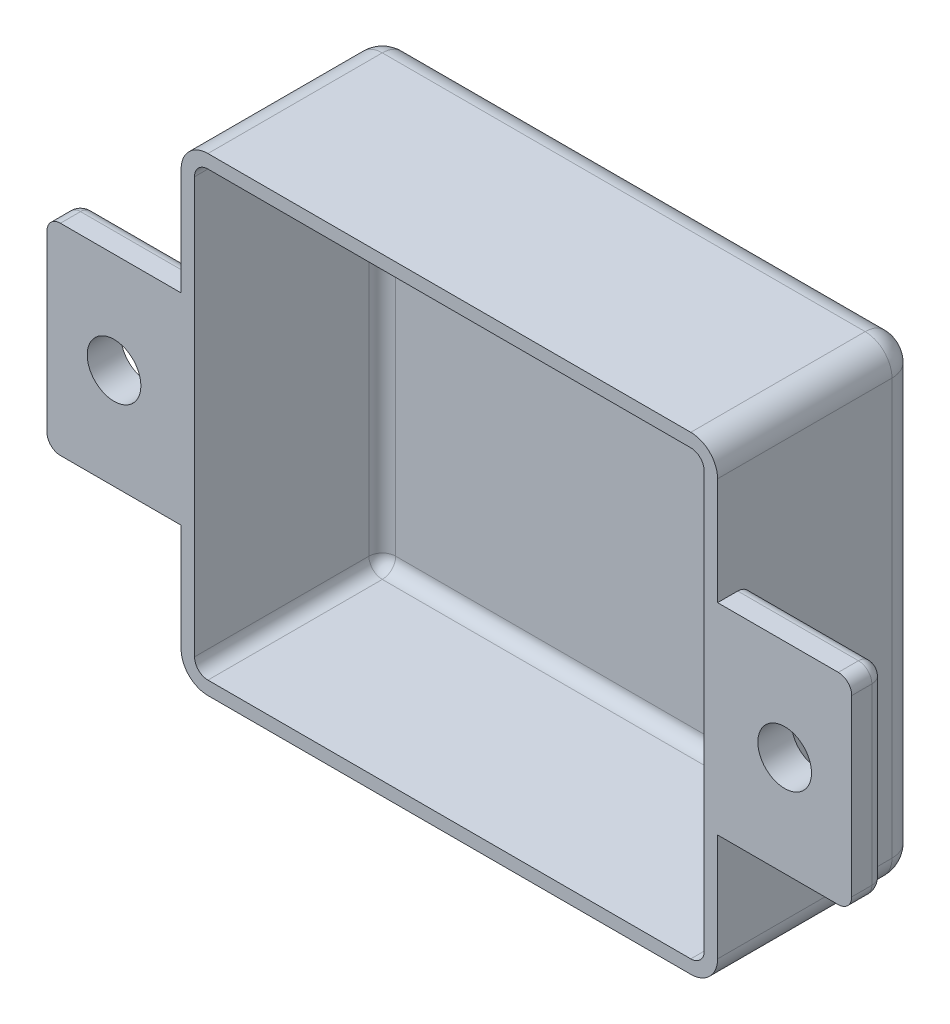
ISO-10303-21;
HEADER;
FILE_DESCRIPTION(('STEP AP214'),'2;1');
FILE_NAME('part.step','',(''),(''),'','','');
FILE_SCHEMA(('AUTOMOTIVE_DESIGN { 1 0 10303 214 1 1 1 1 }'));
ENDSEC;
DATA;
#1=APPLICATION_CONTEXT('core data for automotive mechanical design processes');
#2=APPLICATION_PROTOCOL_DEFINITION('international standard','automotive_design',2000,#1);
#3=PRODUCT_CONTEXT('',#1,'mechanical');
#4=PRODUCT('Part','Part','',(#3));
#5=PRODUCT_RELATED_PRODUCT_CATEGORY('part','',(#4));
#6=PRODUCT_DEFINITION_FORMATION('','',#4);
#7=PRODUCT_DEFINITION_CONTEXT('part definition',#1,'design');
#8=PRODUCT_DEFINITION('design','',#6,#7);
#9=PRODUCT_DEFINITION_SHAPE('','',#8);
#10=(LENGTH_UNIT() NAMED_UNIT(*) SI_UNIT(.MILLI.,.METRE.));
#11=(NAMED_UNIT(*) PLANE_ANGLE_UNIT() SI_UNIT($,.RADIAN.));
#12=(NAMED_UNIT(*) SI_UNIT($,.STERADIAN.) SOLID_ANGLE_UNIT());
#13=UNCERTAINTY_MEASURE_WITH_UNIT(LENGTH_MEASURE(1.E-05),#10,'distance_accuracy_value','');
#14=(GEOMETRIC_REPRESENTATION_CONTEXT(3) GLOBAL_UNCERTAINTY_ASSIGNED_CONTEXT((#13)) GLOBAL_UNIT_ASSIGNED_CONTEXT((#10,
#11,#12)) REPRESENTATION_CONTEXT('',''));
#15=CARTESIAN_POINT('',(0.,0.,0.));
#16=DIRECTION('',(0.,0.,1.));
#17=DIRECTION('',(1.,0.,0.));
#18=AXIS2_PLACEMENT_3D('',#15,#16,#17);
#19=CARTESIAN_POINT('',(-50.8,-44.45,38.1));
#20=DIRECTION('',(0.,0.,1.));
#21=DIRECTION('',(1.,0.,0.));
#22=AXIS2_PLACEMENT_3D('',#19,#20,#21);
#23=PLANE('',#22);
#24=DIRECTION('',(0.,1.,0.));
#25=VECTOR('',#24,1.);
#26=CARTESIAN_POINT('',(-76.2,19.05,38.1));
#27=LINE('',#26,#25);
#28=CARTESIAN_POINT('',(-76.2,-16.51,38.1));
#29=VERTEX_POINT('',#28);
#30=CARTESIAN_POINT('',(-76.2,16.51,38.1));
#31=VERTEX_POINT('',#30);
#32=EDGE_CURVE('E281',#29,#31,#27,.T.);
#33=ORIENTED_EDGE('',*,*,#32,.F.);
#34=CARTESIAN_POINT('',(-73.66,-16.51,38.1));
#35=DIRECTION('',(0.,0.,1.));
#36=DIRECTION('',(1.,0.,0.));
#37=AXIS2_PLACEMENT_3D('',#34,#35,#36);
#38=CIRCLE('',#37,2.54);
#39=CARTESIAN_POINT('',(-73.66,-19.05,38.1));
#40=VERTEX_POINT('',#39);
#41=EDGE_CURVE('E390',#29,#40,#38,.T.);
#42=ORIENTED_EDGE('',*,*,#41,.T.);
#43=DIRECTION('',(-1.,0.,0.));
#44=VECTOR('',#43,1.);
#45=CARTESIAN_POINT('',(-76.2,-19.05,38.1));
#46=LINE('',#45,#44);
#47=CARTESIAN_POINT('',(-50.8,-19.05,38.1));
#48=VERTEX_POINT('',#47);
#49=EDGE_CURVE('E409',#48,#40,#46,.T.);
#50=ORIENTED_EDGE('',*,*,#49,.F.);
#51=DIRECTION('',(0.,-1.,0.));
#52=VECTOR('',#51,1.);
#53=CARTESIAN_POINT('',(-50.8,44.45,38.1));
#54=LINE('',#53,#52);
#55=CARTESIAN_POINT('',(-50.8,-39.37,38.1));
#56=VERTEX_POINT('',#55);
#57=EDGE_CURVE('E290',#48,#56,#54,.T.);
#58=ORIENTED_EDGE('',*,*,#57,.T.);
#59=CARTESIAN_POINT('',(-45.72,-39.37,38.1));
#60=DIRECTION('',(0.,0.,1.));
#61=DIRECTION('',(1.,0.,0.));
#62=AXIS2_PLACEMENT_3D('',#59,#60,#61);
#63=CIRCLE('',#62,5.08);
#64=CARTESIAN_POINT('',(-45.72,-44.45,38.1));
#65=VERTEX_POINT('',#64);
#66=EDGE_CURVE('E340',#56,#65,#63,.T.);
#67=ORIENTED_EDGE('',*,*,#66,.T.);
#68=DIRECTION('',(1.,0.,0.));
#69=VECTOR('',#68,1.);
#70=CARTESIAN_POINT('',(-50.8,-44.45,38.1));
#71=LINE('',#70,#69);
#72=CARTESIAN_POINT('',(45.72,-44.45,38.1));
#73=VERTEX_POINT('',#72);
#74=EDGE_CURVE('E289',#65,#73,#71,.T.);
#75=ORIENTED_EDGE('',*,*,#74,.T.);
#76=CARTESIAN_POINT('',(45.72,-39.37,38.1));
#77=DIRECTION('',(0.,0.,1.));
#78=DIRECTION('',(1.,0.,0.));
#79=AXIS2_PLACEMENT_3D('',#76,#77,#78);
#80=CIRCLE('',#79,5.08);
#81=CARTESIAN_POINT('',(50.8,-39.37,38.1));
#82=VERTEX_POINT('',#81);
#83=EDGE_CURVE('E342',#73,#82,#80,.T.);
#84=ORIENTED_EDGE('',*,*,#83,.T.);
#85=DIRECTION('',(0.,1.,0.));
#86=VECTOR('',#85,1.);
#87=CARTESIAN_POINT('',(50.8,44.45,38.1));
#88=LINE('',#87,#86);
#89=CARTESIAN_POINT('',(50.8,-19.05,38.1));
#90=VERTEX_POINT('',#89);
#91=EDGE_CURVE('E299',#82,#90,#88,.T.);
#92=ORIENTED_EDGE('',*,*,#91,.T.);
#93=DIRECTION('',(1.,0.,0.));
#94=VECTOR('',#93,1.);
#95=CARTESIAN_POINT('',(76.2,-19.05,38.1));
#96=LINE('',#95,#94);
#97=CARTESIAN_POINT('',(73.66,-19.05,38.1));
#98=VERTEX_POINT('',#97);
#99=EDGE_CURVE('E448',#90,#98,#96,.T.);
#100=ORIENTED_EDGE('',*,*,#99,.T.);
#101=CARTESIAN_POINT('',(73.66,-16.51,38.1));
#102=DIRECTION('',(0.,0.,1.));
#103=DIRECTION('',(1.,0.,0.));
#104=AXIS2_PLACEMENT_3D('',#101,#102,#103);
#105=CIRCLE('',#104,2.54);
#106=CARTESIAN_POINT('',(76.2,-16.51,38.1));
#107=VERTEX_POINT('',#106);
#108=EDGE_CURVE('E354',#98,#107,#105,.T.);
#109=ORIENTED_EDGE('',*,*,#108,.T.);
#110=DIRECTION('',(0.,1.,0.));
#111=VECTOR('',#110,1.);
#112=CARTESIAN_POINT('',(76.2,19.05,38.1));
#113=LINE('',#112,#111);
#114=CARTESIAN_POINT('',(76.2,16.51,38.1));
#115=VERTEX_POINT('',#114);
#116=EDGE_CURVE('E451',#107,#115,#113,.T.);
#117=ORIENTED_EDGE('',*,*,#116,.T.);
#118=CARTESIAN_POINT('',(73.66,16.51,38.1));
#119=DIRECTION('',(0.,0.,1.));
#120=DIRECTION('',(1.,0.,0.));
#121=AXIS2_PLACEMENT_3D('',#118,#119,#120);
#122=CIRCLE('',#121,2.54);
#123=CARTESIAN_POINT('',(73.66,19.05,38.1));
#124=VERTEX_POINT('',#123);
#125=EDGE_CURVE('E352',#115,#124,#122,.T.);
#126=ORIENTED_EDGE('',*,*,#125,.T.);
#127=DIRECTION('',(-1.,0.,0.));
#128=VECTOR('',#127,1.);
#129=CARTESIAN_POINT('',(50.8,19.05,38.1));
#130=LINE('',#129,#128);
#131=CARTESIAN_POINT('',(50.8,19.05,38.1));
#132=VERTEX_POINT('',#131);
#133=EDGE_CURVE('E454',#124,#132,#130,.T.);
#134=ORIENTED_EDGE('',*,*,#133,.T.);
#135=CARTESIAN_POINT('',(50.8,39.37,38.1));
#136=VERTEX_POINT('',#135);
#137=EDGE_CURVE('E293',#132,#136,#88,.T.);
#138=ORIENTED_EDGE('',*,*,#137,.T.);
#139=CARTESIAN_POINT('',(45.72,39.37,38.1));
#140=DIRECTION('',(0.,0.,1.));
#141=DIRECTION('',(1.,0.,0.));
#142=AXIS2_PLACEMENT_3D('',#139,#140,#141);
#143=CIRCLE('',#142,5.08);
#144=CARTESIAN_POINT('',(45.72,44.45,38.1));
#145=VERTEX_POINT('',#144);
#146=EDGE_CURVE('E345',#136,#145,#143,.T.);
#147=ORIENTED_EDGE('',*,*,#146,.T.);
#148=DIRECTION('',(-1.,0.,0.));
#149=VECTOR('',#148,1.);
#150=CARTESIAN_POINT('',(-50.8,44.45,38.1));
#151=LINE('',#150,#149);
#152=CARTESIAN_POINT('',(-45.72,44.45,38.1));
#153=VERTEX_POINT('',#152);
#154=EDGE_CURVE('E302',#145,#153,#151,.T.);
#155=ORIENTED_EDGE('',*,*,#154,.T.);
#156=CARTESIAN_POINT('',(-45.72,39.37,38.1));
#157=DIRECTION('',(0.,0.,1.));
#158=DIRECTION('',(1.,0.,0.));
#159=AXIS2_PLACEMENT_3D('',#156,#157,#158);
#160=CIRCLE('',#159,5.08);
#161=CARTESIAN_POINT('',(-50.8,39.37,38.1));
#162=VERTEX_POINT('',#161);
#163=EDGE_CURVE('E288',#153,#162,#160,.T.);
#164=ORIENTED_EDGE('',*,*,#163,.T.);
#165=CARTESIAN_POINT('',(-50.8,19.05,38.1));
#166=VERTEX_POINT('',#165);
#167=EDGE_CURVE('E265',#162,#166,#54,.T.);
#168=ORIENTED_EDGE('',*,*,#167,.T.);
#169=DIRECTION('',(1.,0.,0.));
#170=VECTOR('',#169,1.);
#171=CARTESIAN_POINT('',(-50.8,19.05,38.1));
#172=LINE('',#171,#170);
#173=CARTESIAN_POINT('',(-73.66,19.05,38.1));
#174=VERTEX_POINT('',#173);
#175=EDGE_CURVE('E275',#174,#166,#172,.T.);
#176=ORIENTED_EDGE('',*,*,#175,.F.);
#177=CARTESIAN_POINT('',(-73.66,16.51,38.1));
#178=DIRECTION('',(0.,0.,1.));
#179=DIRECTION('',(1.,0.,0.));
#180=AXIS2_PLACEMENT_3D('',#177,#178,#179);
#181=CIRCLE('',#180,2.54);
#182=EDGE_CURVE('E388',#174,#31,#181,.T.);
#183=ORIENTED_EDGE('',*,*,#182,.T.);
#184=EDGE_LOOP('',(#33,#42,#50,#58,#67,#75,#84,#92,#100,#109,#117,#126,#134,#138,#147,#155,#164,
#168,#176,#183));
#185=FACE_BOUND('',#184,.T.);
#186=DIRECTION('',(0.,1.,0.));
#187=VECTOR('',#186,1.);
#188=CARTESIAN_POINT('',(48.26,44.45,38.1));
#189=LINE('',#188,#187);
#190=CARTESIAN_POINT('',(48.26,-39.37,38.1));
#191=VERTEX_POINT('',#190);
#192=CARTESIAN_POINT('',(48.26,39.37,38.1));
#193=VERTEX_POINT('',#192);
#194=EDGE_CURVE('E542',#191,#193,#189,.T.);
#195=ORIENTED_EDGE('',*,*,#194,.F.);
#196=CARTESIAN_POINT('',(45.72,-39.37,38.1));
#197=DIRECTION('',(0.,0.,1.));
#198=DIRECTION('',(1.,0.,0.));
#199=AXIS2_PLACEMENT_3D('',#196,#197,#198);
#200=CIRCLE('',#199,2.54);
#201=CARTESIAN_POINT('',(45.72,-41.91,38.1));
#202=VERTEX_POINT('',#201);
#203=EDGE_CURVE('E540',#202,#191,#200,.T.);
#204=ORIENTED_EDGE('',*,*,#203,.F.);
#205=DIRECTION('',(1.,0.,0.));
#206=VECTOR('',#205,1.);
#207=CARTESIAN_POINT('',(-50.8,-41.91,38.1));
#208=LINE('',#207,#206);
#209=CARTESIAN_POINT('',(-45.72,-41.91,38.1));
#210=VERTEX_POINT('',#209);
#211=EDGE_CURVE('E538',#210,#202,#208,.T.);
#212=ORIENTED_EDGE('',*,*,#211,.F.);
#213=CARTESIAN_POINT('',(-45.72,-39.37,38.1));
#214=DIRECTION('',(0.,0.,1.));
#215=DIRECTION('',(1.,0.,0.));
#216=AXIS2_PLACEMENT_3D('',#213,#214,#215);
#217=CIRCLE('',#216,2.54);
#218=CARTESIAN_POINT('',(-48.26,-39.37,38.1));
#219=VERTEX_POINT('',#218);
#220=EDGE_CURVE('E467',#219,#210,#217,.T.);
#221=ORIENTED_EDGE('',*,*,#220,.F.);
#222=DIRECTION('',(0.,-1.,0.));
#223=VECTOR('',#222,1.);
#224=CARTESIAN_POINT('',(-48.26,44.45,38.1));
#225=LINE('',#224,#223);
#226=CARTESIAN_POINT('',(-48.26,39.37,38.1));
#227=VERTEX_POINT('',#226);
#228=EDGE_CURVE('E511',#227,#219,#225,.T.);
#229=ORIENTED_EDGE('',*,*,#228,.F.);
#230=CARTESIAN_POINT('',(-45.72,39.37,38.1));
#231=DIRECTION('',(0.,0.,1.));
#232=DIRECTION('',(1.,0.,0.));
#233=AXIS2_PLACEMENT_3D('',#230,#231,#232);
#234=CIRCLE('',#233,2.54);
#235=CARTESIAN_POINT('',(-45.72,41.91,38.1));
#236=VERTEX_POINT('',#235);
#237=EDGE_CURVE('E544',#236,#227,#234,.T.);
#238=ORIENTED_EDGE('',*,*,#237,.F.);
#239=DIRECTION('',(-1.,0.,0.));
#240=VECTOR('',#239,1.);
#241=CARTESIAN_POINT('',(-50.8,41.91,38.1));
#242=LINE('',#241,#240);
#243=CARTESIAN_POINT('',(45.72,41.91,38.1));
#244=VERTEX_POINT('',#243);
#245=EDGE_CURVE('E523',#244,#236,#242,.T.);
#246=ORIENTED_EDGE('',*,*,#245,.F.);
#247=CARTESIAN_POINT('',(45.72,39.37,38.1));
#248=DIRECTION('',(0.,0.,1.));
#249=DIRECTION('',(1.,0.,0.));
#250=AXIS2_PLACEMENT_3D('',#247,#248,#249);
#251=CIRCLE('',#250,2.54);
#252=EDGE_CURVE('E547',#193,#244,#251,.T.);
#253=ORIENTED_EDGE('',*,*,#252,.F.);
#254=EDGE_LOOP('',(#195,#204,#212,#221,#229,#238,#246,#253));
#255=FACE_BOUND('',#254,.T.);
#256=CARTESIAN_POINT('',(63.5,0.,38.1));
#257=DIRECTION('',(0.,0.,1.));
#258=DIRECTION('',(1.,0.,0.));
#259=AXIS2_PLACEMENT_3D('',#256,#257,#258);
#260=CIRCLE('',#259,5.08);
#261=CARTESIAN_POINT('',(68.58,0.,38.1));
#262=VERTEX_POINT('',#261);
#263=EDGE_CURVE('E381',#262,#262,#260,.T.);
#264=ORIENTED_EDGE('',*,*,#263,.F.);
#265=EDGE_LOOP('',(#264));
#266=FACE_BOUND('',#265,.T.);
#267=CARTESIAN_POINT('',(-63.5,0.,38.1));
#268=DIRECTION('',(0.,0.,-1.));
#269=DIRECTION('',(-1.,0.,0.));
#270=AXIS2_PLACEMENT_3D('',#267,#268,#269);
#271=CIRCLE('',#270,5.08);
#272=CARTESIAN_POINT('',(-58.42,0.,38.1));
#273=VERTEX_POINT('',#272);
#274=EDGE_CURVE('E1157',#273,#273,#271,.T.);
#275=ORIENTED_EDGE('',*,*,#274,.T.);
#276=EDGE_LOOP('',(#275));
#277=FACE_BOUND('',#276,.T.);
#278=ADVANCED_FACE('F29',(#185,#255,#266,#277),#23,.T.);
#279=CARTESIAN_POINT('',(-50.8,19.05,31.75));
#280=DIRECTION('',(0.,0.,-1.));
#281=DIRECTION('',(1.,0.,0.));
#282=AXIS2_PLACEMENT_3D('',#279,#280,#281);
#283=PLANE('',#282);
#284=DIRECTION('',(0.,1.,0.));
#285=VECTOR('',#284,1.);
#286=CARTESIAN_POINT('',(-73.66,19.05,31.75));
#287=LINE('',#286,#285);
#288=CARTESIAN_POINT('',(-73.66,-16.51,31.75));
#289=VERTEX_POINT('',#288);
#290=CARTESIAN_POINT('',(-73.66,16.51,31.75));
#291=VERTEX_POINT('',#290);
#292=EDGE_CURVE('E45',#289,#291,#287,.T.);
#293=ORIENTED_EDGE('',*,*,#292,.T.);
#294=DIRECTION('',(1.,0.,0.));
#295=VECTOR('',#294,1.);
#296=CARTESIAN_POINT('',(-50.8,16.51,31.75));
#297=LINE('',#296,#295);
#298=CARTESIAN_POINT('',(-50.8,16.51,31.75));
#299=VERTEX_POINT('',#298);
#300=EDGE_CURVE('E401',#291,#299,#297,.T.);
#301=ORIENTED_EDGE('',*,*,#300,.T.);
#302=DIRECTION('',(0.,-1.,0.));
#303=VECTOR('',#302,1.);
#304=CARTESIAN_POINT('',(-50.8,-19.05,31.75));
#305=LINE('',#304,#303);
#306=CARTESIAN_POINT('',(-50.8,-16.51,31.75));
#307=VERTEX_POINT('',#306);
#308=EDGE_CURVE('E272',#299,#307,#305,.T.);
#309=ORIENTED_EDGE('',*,*,#308,.T.);
#310=DIRECTION('',(-1.,0.,0.));
#311=VECTOR('',#310,1.);
#312=CARTESIAN_POINT('',(-76.2,-16.51,31.75));
#313=LINE('',#312,#311);
#314=EDGE_CURVE('E50',#307,#289,#313,.T.);
#315=ORIENTED_EDGE('',*,*,#314,.T.);
#316=EDGE_LOOP('',(#293,#301,#309,#315));
#317=FACE_BOUND('',#316,.T.);
#318=CARTESIAN_POINT('',(-63.5,0.,31.75));
#319=DIRECTION('',(0.,0.,-1.));
#320=DIRECTION('',(-1.,0.,0.));
#321=AXIS2_PLACEMENT_3D('',#318,#319,#320);
#322=CIRCLE('',#321,5.08);
#323=CARTESIAN_POINT('',(-58.42,0.,31.75));
#324=VERTEX_POINT('',#323);
#325=EDGE_CURVE('E33',#324,#324,#322,.F.);
#326=ORIENTED_EDGE('',*,*,#325,.T.);
#327=EDGE_LOOP('',(#326));
#328=FACE_BOUND('',#327,.T.);
#329=ADVANCED_FACE('F403',(#317,#328),#283,.T.);
#330=CARTESIAN_POINT('',(-50.8,44.45,38.1));
#331=DIRECTION('',(1.,0.,0.));
#332=DIRECTION('',(0.,1.,0.));
#333=AXIS2_PLACEMENT_3D('',#330,#331,#332);
#334=PLANE('',#333);
#335=DIRECTION('',(0.,0.,1.));
#336=VECTOR('',#335,1.);
#337=CARTESIAN_POINT('',(-50.8,-19.05,31.75));
#338=LINE('',#337,#336);
#339=CARTESIAN_POINT('',(-50.8,-19.05,34.29));
#340=VERTEX_POINT('',#339);
#341=EDGE_CURVE('E271',#340,#48,#338,.T.);
#342=ORIENTED_EDGE('',*,*,#341,.F.);
#343=CARTESIAN_POINT('',(-50.8,-16.51,34.29));
#344=DIRECTION('',(1.,0.,0.));
#345=DIRECTION('',(0.,1.,0.));
#346=AXIS2_PLACEMENT_3D('',#343,#344,#345);
#347=CIRCLE('',#346,2.54);
#348=EDGE_CURVE('E11',#340,#307,#347,.T.);
#349=ORIENTED_EDGE('',*,*,#348,.T.);
#350=ORIENTED_EDGE('',*,*,#308,.F.);
#351=CARTESIAN_POINT('',(-50.8,16.51,34.29));
#352=DIRECTION('',(1.,0.,0.));
#353=DIRECTION('',(0.,1.,0.));
#354=AXIS2_PLACEMENT_3D('',#351,#352,#353);
#355=CIRCLE('',#354,2.54);
#356=CARTESIAN_POINT('',(-50.8,19.05,34.29));
#357=VERTEX_POINT('',#356);
#358=EDGE_CURVE('E38',#299,#357,#355,.T.);
#359=ORIENTED_EDGE('',*,*,#358,.T.);
#360=DIRECTION('',(0.,0.,1.));
#361=VECTOR('',#360,1.);
#362=CARTESIAN_POINT('',(-50.8,19.05,31.75));
#363=LINE('',#362,#361);
#364=EDGE_CURVE('E261',#357,#166,#363,.T.);
#365=ORIENTED_EDGE('',*,*,#364,.T.);
#366=ORIENTED_EDGE('',*,*,#167,.F.);
#367=DIRECTION('',(0.,0.,-1.));
#368=VECTOR('',#367,1.);
#369=CARTESIAN_POINT('',(-50.8,39.37,38.1));
#370=LINE('',#369,#368);
#371=CARTESIAN_POINT('',(-50.8,39.37,5.08));
#372=VERTEX_POINT('',#371);
#373=EDGE_CURVE('E338',#162,#372,#370,.T.);
#374=ORIENTED_EDGE('',*,*,#373,.T.);
#375=DIRECTION('',(0.,-1.,0.));
#376=VECTOR('',#375,1.);
#377=CARTESIAN_POINT('',(-50.8,44.45,5.08));
#378=LINE('',#377,#376);
#379=CARTESIAN_POINT('',(-50.8,-39.37,5.08));
#380=VERTEX_POINT('',#379);
#381=EDGE_CURVE('E336',#372,#380,#378,.T.);
#382=ORIENTED_EDGE('',*,*,#381,.T.);
#383=DIRECTION('',(0.,0.,-1.));
#384=VECTOR('',#383,1.);
#385=CARTESIAN_POINT('',(-50.8,-39.37,38.1));
#386=LINE('',#385,#384);
#387=EDGE_CURVE('E333',#380,#56,#386,.F.);
#388=ORIENTED_EDGE('',*,*,#387,.T.);
#389=ORIENTED_EDGE('',*,*,#57,.F.);
#390=EDGE_LOOP('',(#342,#349,#350,#359,#365,#366,#374,#382,#388,#389));
#391=FACE_BOUND('',#390,.T.);
#392=ADVANCED_FACE('F31',(#391),#334,.F.);
#393=CARTESIAN_POINT('',(-50.8,-44.45,38.1));
#394=DIRECTION('',(0.,1.,0.));
#395=DIRECTION('',(0.,0.,1.));
#396=AXIS2_PLACEMENT_3D('',#393,#394,#395);
#397=PLANE('',#396);
#398=DIRECTION('',(1.,0.,0.));
#399=VECTOR('',#398,1.);
#400=CARTESIAN_POINT('',(-50.8,-44.45,5.08));
#401=LINE('',#400,#399);
#402=CARTESIAN_POINT('',(-45.72,-44.45,5.08));
#403=VERTEX_POINT('',#402);
#404=CARTESIAN_POINT('',(45.72,-44.45,5.08));
#405=VERTEX_POINT('',#404);
#406=EDGE_CURVE('E306',#403,#405,#401,.T.);
#407=ORIENTED_EDGE('',*,*,#406,.T.);
#408=DIRECTION('',(0.,0.,-1.));
#409=VECTOR('',#408,1.);
#410=CARTESIAN_POINT('',(45.72,-44.45,38.1));
#411=LINE('',#410,#409);
#412=EDGE_CURVE('E309',#405,#73,#411,.F.);
#413=ORIENTED_EDGE('',*,*,#412,.T.);
#414=ORIENTED_EDGE('',*,*,#74,.F.);
#415=DIRECTION('',(0.,0.,-1.));
#416=VECTOR('',#415,1.);
#417=CARTESIAN_POINT('',(-45.72,-44.45,38.1));
#418=LINE('',#417,#416);
#419=EDGE_CURVE('E304',#65,#403,#418,.T.);
#420=ORIENTED_EDGE('',*,*,#419,.T.);
#421=EDGE_LOOP('',(#407,#413,#414,#420));
#422=FACE_BOUND('',#421,.T.);
#423=ADVANCED_FACE('F607',(#422),#397,.F.);
#424=CARTESIAN_POINT('',(50.8,44.45,38.1));
#425=DIRECTION('',(-1.,0.,0.));
#426=DIRECTION('',(0.,-1.,0.));
#427=AXIS2_PLACEMENT_3D('',#424,#425,#426);
#428=PLANE('',#427);
#429=ORIENTED_EDGE('',*,*,#137,.F.);
#430=DIRECTION('',(0.,0.,1.));
#431=VECTOR('',#430,1.);
#432=CARTESIAN_POINT('',(50.8,19.05,31.75));
#433=LINE('',#432,#431);
#434=CARTESIAN_POINT('',(50.8,19.05,34.29));
#435=VERTEX_POINT('',#434);
#436=EDGE_CURVE('E461',#435,#132,#433,.T.);
#437=ORIENTED_EDGE('',*,*,#436,.F.);
#438=CARTESIAN_POINT('',(50.8,16.51,34.29));
#439=DIRECTION('',(-1.,0.,0.));
#440=DIRECTION('',(0.,-1.,0.));
#441=AXIS2_PLACEMENT_3D('',#438,#439,#440);
#442=CIRCLE('',#441,2.54);
#443=CARTESIAN_POINT('',(50.8,16.51,31.75));
#444=VERTEX_POINT('',#443);
#445=EDGE_CURVE('E372',#435,#444,#442,.T.);
#446=ORIENTED_EDGE('',*,*,#445,.T.);
#447=DIRECTION('',(0.,-1.,0.));
#448=VECTOR('',#447,1.);
#449=CARTESIAN_POINT('',(50.8,-19.05,31.75));
#450=LINE('',#449,#448);
#451=CARTESIAN_POINT('',(50.8,-16.51,31.75));
#452=VERTEX_POINT('',#451);
#453=EDGE_CURVE('E457',#444,#452,#450,.T.);
#454=ORIENTED_EDGE('',*,*,#453,.T.);
#455=CARTESIAN_POINT('',(50.8,-16.51,34.29));
#456=DIRECTION('',(-1.,0.,0.));
#457=DIRECTION('',(0.,-1.,0.));
#458=AXIS2_PLACEMENT_3D('',#455,#456,#457);
#459=CIRCLE('',#458,2.54);
#460=CARTESIAN_POINT('',(50.8,-19.05,34.29));
#461=VERTEX_POINT('',#460);
#462=EDGE_CURVE('E374',#452,#461,#459,.T.);
#463=ORIENTED_EDGE('',*,*,#462,.T.);
#464=DIRECTION('',(0.,0.,1.));
#465=VECTOR('',#464,1.);
#466=CARTESIAN_POINT('',(50.8,-19.05,31.75));
#467=LINE('',#466,#465);
#468=EDGE_CURVE('E460',#461,#90,#467,.T.);
#469=ORIENTED_EDGE('',*,*,#468,.T.);
#470=ORIENTED_EDGE('',*,*,#91,.F.);
#471=DIRECTION('',(0.,0.,-1.));
#472=VECTOR('',#471,1.);
#473=CARTESIAN_POINT('',(50.8,-39.37,38.1));
#474=LINE('',#473,#472);
#475=CARTESIAN_POINT('',(50.8,-39.37,5.08));
#476=VERTEX_POINT('',#475);
#477=EDGE_CURVE('E320',#82,#476,#474,.T.);
#478=ORIENTED_EDGE('',*,*,#477,.T.);
#479=DIRECTION('',(0.,1.,0.));
#480=VECTOR('',#479,1.);
#481=CARTESIAN_POINT('',(50.8,44.45,5.08));
#482=LINE('',#481,#480);
#483=CARTESIAN_POINT('',(50.8,39.37,5.08));
#484=VERTEX_POINT('',#483);
#485=EDGE_CURVE('E322',#476,#484,#482,.T.);
#486=ORIENTED_EDGE('',*,*,#485,.T.);
#487=DIRECTION('',(0.,0.,-1.));
#488=VECTOR('',#487,1.);
#489=CARTESIAN_POINT('',(50.8,39.37,38.1));
#490=LINE('',#489,#488);
#491=EDGE_CURVE('E324',#484,#136,#490,.F.);
#492=ORIENTED_EDGE('',*,*,#491,.T.);
#493=EDGE_LOOP('',(#429,#437,#446,#454,#463,#469,#470,#478,#486,#492));
#494=FACE_BOUND('',#493,.T.);
#495=ADVANCED_FACE('F617',(#494),#428,.F.);
#496=CARTESIAN_POINT('',(-50.8,44.45,38.1));
#497=DIRECTION('',(0.,-1.,0.));
#498=DIRECTION('',(0.,0.,-1.));
#499=AXIS2_PLACEMENT_3D('',#496,#497,#498);
#500=PLANE('',#499);
#501=ORIENTED_EDGE('',*,*,#154,.F.);
#502=DIRECTION('',(0.,0.,-1.));
#503=VECTOR('',#502,1.);
#504=CARTESIAN_POINT('',(45.72,44.45,38.1));
#505=LINE('',#504,#503);
#506=CARTESIAN_POINT('',(45.72,44.45,5.08));
#507=VERTEX_POINT('',#506);
#508=EDGE_CURVE('E331',#145,#507,#505,.T.);
#509=ORIENTED_EDGE('',*,*,#508,.T.);
#510=DIRECTION('',(-1.,0.,0.));
#511=VECTOR('',#510,1.);
#512=CARTESIAN_POINT('',(-50.8,44.45,5.08));
#513=LINE('',#512,#511);
#514=CARTESIAN_POINT('',(-45.72,44.45,5.08));
#515=VERTEX_POINT('',#514);
#516=EDGE_CURVE('E329',#507,#515,#513,.T.);
#517=ORIENTED_EDGE('',*,*,#516,.T.);
#518=DIRECTION('',(0.,0.,-1.));
#519=VECTOR('',#518,1.);
#520=CARTESIAN_POINT('',(-45.72,44.45,38.1));
#521=LINE('',#520,#519);
#522=EDGE_CURVE('E327',#515,#153,#521,.F.);
#523=ORIENTED_EDGE('',*,*,#522,.T.);
#524=EDGE_LOOP('',(#501,#509,#517,#523));
#525=FACE_BOUND('',#524,.T.);
#526=ADVANCED_FACE('F667',(#525),#500,.F.);
#527=CARTESIAN_POINT('',(-50.8,-44.45,0.));
#528=DIRECTION('',(0.,0.,1.));
#529=DIRECTION('',(1.,0.,0.));
#530=AXIS2_PLACEMENT_3D('',#527,#528,#529);
#531=PLANE('',#530);
#532=DIRECTION('',(0.,1.,0.));
#533=VECTOR('',#532,1.);
#534=CARTESIAN_POINT('',(45.72,-44.45,0.));
#535=LINE('',#534,#533);
#536=CARTESIAN_POINT('',(45.72,39.37,0.));
#537=VERTEX_POINT('',#536);
#538=CARTESIAN_POINT('',(45.72,-39.37,0.));
#539=VERTEX_POINT('',#538);
#540=EDGE_CURVE('E315',#537,#539,#535,.F.);
#541=ORIENTED_EDGE('',*,*,#540,.T.);
#542=DIRECTION('',(1.,0.,0.));
#543=VECTOR('',#542,1.);
#544=CARTESIAN_POINT('',(-50.8,-39.37,0.));
#545=LINE('',#544,#543);
#546=CARTESIAN_POINT('',(-45.72,-39.37,0.));
#547=VERTEX_POINT('',#546);
#548=EDGE_CURVE('E317',#539,#547,#545,.F.);
#549=ORIENTED_EDGE('',*,*,#548,.T.);
#550=DIRECTION('',(0.,-1.,0.));
#551=VECTOR('',#550,1.);
#552=CARTESIAN_POINT('',(-45.72,-44.45,0.));
#553=LINE('',#552,#551);
#554=CARTESIAN_POINT('',(-45.72,39.37,0.));
#555=VERTEX_POINT('',#554);
#556=EDGE_CURVE('E311',#547,#555,#553,.F.);
#557=ORIENTED_EDGE('',*,*,#556,.T.);
#558=DIRECTION('',(-1.,0.,0.));
#559=VECTOR('',#558,1.);
#560=CARTESIAN_POINT('',(-50.8,39.37,0.));
#561=LINE('',#560,#559);
#562=EDGE_CURVE('E313',#555,#537,#561,.F.);
#563=ORIENTED_EDGE('',*,*,#562,.T.);
#564=EDGE_LOOP('',(#541,#549,#557,#563));
#565=FACE_BOUND('',#564,.T.);
#566=ADVANCED_FACE('F680',(#565),#531,.F.);
#567=CARTESIAN_POINT('',(-45.72,39.37,38.1));
#568=DIRECTION('',(0.,0.,-1.));
#569=DIRECTION('',(-1.,0.,0.));
#570=AXIS2_PLACEMENT_3D('',#567,#568,#569);
#571=CYLINDRICAL_SURFACE('',#570,5.08);
#572=ORIENTED_EDGE('',*,*,#163,.F.);
#573=ORIENTED_EDGE('',*,*,#522,.F.);
#574=CARTESIAN_POINT('',(-45.72,39.37,5.08));
#575=DIRECTION('',(0.,0.,-1.));
#576=DIRECTION('',(-1.,0.,0.));
#577=AXIS2_PLACEMENT_3D('',#574,#575,#576);
#578=CIRCLE('',#577,5.08);
#579=EDGE_CURVE('E579',#372,#515,#578,.T.);
#580=ORIENTED_EDGE('',*,*,#579,.F.);
#581=ORIENTED_EDGE('',*,*,#373,.F.);
#582=EDGE_LOOP('',(#572,#573,#580,#581));
#583=FACE_BOUND('',#582,.T.);
#584=ADVANCED_FACE('F678',(#583),#571,.T.);
#585=CARTESIAN_POINT('',(45.72,39.37,38.1));
#586=DIRECTION('',(0.,0.,-1.));
#587=DIRECTION('',(-1.,0.,0.));
#588=AXIS2_PLACEMENT_3D('',#585,#586,#587);
#589=CYLINDRICAL_SURFACE('',#588,5.08);
#590=ORIENTED_EDGE('',*,*,#146,.F.);
#591=ORIENTED_EDGE('',*,*,#491,.F.);
#592=CARTESIAN_POINT('',(45.72,39.37,5.08));
#593=DIRECTION('',(0.,0.,-1.));
#594=DIRECTION('',(-1.,0.,0.));
#595=AXIS2_PLACEMENT_3D('',#592,#593,#594);
#596=CIRCLE('',#595,5.08);
#597=EDGE_CURVE('E577',#507,#484,#596,.T.);
#598=ORIENTED_EDGE('',*,*,#597,.F.);
#599=ORIENTED_EDGE('',*,*,#508,.F.);
#600=EDGE_LOOP('',(#590,#591,#598,#599));
#601=FACE_BOUND('',#600,.T.);
#602=ADVANCED_FACE('F670',(#601),#589,.T.);
#603=CARTESIAN_POINT('',(-50.8,39.37,5.08));
#604=DIRECTION('',(-1.,0.,0.));
#605=DIRECTION('',(0.,0.,1.));
#606=AXIS2_PLACEMENT_3D('',#603,#604,#605);
#607=CYLINDRICAL_SURFACE('',#606,5.08);
#608=CARTESIAN_POINT('',(-45.72,39.37,5.08));
#609=DIRECTION('',(-1.,0.,0.));
#610=DIRECTION('',(0.,0.,1.));
#611=AXIS2_PLACEMENT_3D('',#608,#609,#610);
#612=CIRCLE('',#611,5.08);
#613=EDGE_CURVE('E295',#515,#555,#612,.T.);
#614=ORIENTED_EDGE('',*,*,#613,.F.);
#615=ORIENTED_EDGE('',*,*,#516,.F.);
#616=CARTESIAN_POINT('',(45.72,39.37,5.08));
#617=DIRECTION('',(1.,0.,0.));
#618=DIRECTION('',(0.,0.,-1.));
#619=AXIS2_PLACEMENT_3D('',#616,#617,#618);
#620=CIRCLE('',#619,5.08);
#621=EDGE_CURVE('E574',#537,#507,#620,.T.);
#622=ORIENTED_EDGE('',*,*,#621,.F.);
#623=ORIENTED_EDGE('',*,*,#562,.F.);
#624=EDGE_LOOP('',(#614,#615,#622,#623));
#625=FACE_BOUND('',#624,.T.);
#626=ADVANCED_FACE('F676',(#625),#607,.T.);
#627=CARTESIAN_POINT('',(-45.72,39.37,5.08));
#628=DIRECTION('',(0.,0.,1.));
#629=DIRECTION('',(1.,0.,0.));
#630=AXIS2_PLACEMENT_3D('',#627,#628,#629);
#631=SPHERICAL_SURFACE('',#630,5.08);
#632=ORIENTED_EDGE('',*,*,#579,.T.);
#633=ORIENTED_EDGE('',*,*,#613,.T.);
#634=CARTESIAN_POINT('',(-45.72,39.37,5.08));
#635=DIRECTION('',(0.,1.,0.));
#636=DIRECTION('',(0.,0.,1.));
#637=AXIS2_PLACEMENT_3D('',#634,#635,#636);
#638=CIRCLE('',#637,5.08);
#639=EDGE_CURVE('E571',#372,#555,#638,.F.);
#640=ORIENTED_EDGE('',*,*,#639,.F.);
#641=EDGE_LOOP('',(#632,#633,#640));
#642=FACE_BOUND('',#641,.T.);
#643=ADVANCED_FACE('F586',(#642),#631,.T.);
#644=CARTESIAN_POINT('',(45.72,39.37,5.08));
#645=DIRECTION('',(0.,0.,1.));
#646=DIRECTION('',(1.,0.,0.));
#647=AXIS2_PLACEMENT_3D('',#644,#645,#646);
#648=SPHERICAL_SURFACE('',#647,5.08);
#649=ORIENTED_EDGE('',*,*,#621,.T.);
#650=ORIENTED_EDGE('',*,*,#597,.T.);
#651=CARTESIAN_POINT('',(45.72,39.37,5.08));
#652=DIRECTION('',(0.,1.,0.));
#653=DIRECTION('',(0.,0.,1.));
#654=AXIS2_PLACEMENT_3D('',#651,#652,#653);
#655=CIRCLE('',#654,5.08);
#656=EDGE_CURVE('E568',#537,#484,#655,.F.);
#657=ORIENTED_EDGE('',*,*,#656,.F.);
#658=EDGE_LOOP('',(#649,#650,#657));
#659=FACE_BOUND('',#658,.T.);
#660=ADVANCED_FACE('F674',(#659),#648,.T.);
#661=CARTESIAN_POINT('',(-45.72,44.45,5.08));
#662=DIRECTION('',(0.,-1.,0.));
#663=DIRECTION('',(1.,0.,0.));
#664=AXIS2_PLACEMENT_3D('',#661,#662,#663);
#665=CYLINDRICAL_SURFACE('',#664,5.08);
#666=ORIENTED_EDGE('',*,*,#639,.T.);
#667=ORIENTED_EDGE('',*,*,#556,.F.);
#668=CARTESIAN_POINT('',(-45.72,-39.37,5.08));
#669=DIRECTION('',(0.,-1.,0.));
#670=DIRECTION('',(0.,0.,-1.));
#671=AXIS2_PLACEMENT_3D('',#668,#669,#670);
#672=CIRCLE('',#671,5.08);
#673=EDGE_CURVE('E565',#380,#547,#672,.T.);
#674=ORIENTED_EDGE('',*,*,#673,.F.);
#675=ORIENTED_EDGE('',*,*,#381,.F.);
#676=EDGE_LOOP('',(#666,#667,#674,#675));
#677=FACE_BOUND('',#676,.T.);
#678=ADVANCED_FACE('F593',(#677),#665,.T.);
#679=CARTESIAN_POINT('',(-45.72,-39.37,38.1));
#680=DIRECTION('',(0.,0.,-1.));
#681=DIRECTION('',(-1.,0.,0.));
#682=AXIS2_PLACEMENT_3D('',#679,#680,#681);
#683=CYLINDRICAL_SURFACE('',#682,5.08);
#684=ORIENTED_EDGE('',*,*,#66,.F.);
#685=ORIENTED_EDGE('',*,*,#387,.F.);
#686=CARTESIAN_POINT('',(-45.72,-39.37,5.08));
#687=DIRECTION('',(0.,0.,-1.));
#688=DIRECTION('',(-1.,0.,0.));
#689=AXIS2_PLACEMENT_3D('',#686,#687,#688);
#690=CIRCLE('',#689,5.08);
#691=EDGE_CURVE('E562',#403,#380,#690,.T.);
#692=ORIENTED_EDGE('',*,*,#691,.F.);
#693=ORIENTED_EDGE('',*,*,#419,.F.);
#694=EDGE_LOOP('',(#684,#685,#692,#693));
#695=FACE_BOUND('',#694,.T.);
#696=ADVANCED_FACE('F600',(#695),#683,.T.);
#697=CARTESIAN_POINT('',(45.72,-39.37,38.1));
#698=DIRECTION('',(0.,0.,-1.));
#699=DIRECTION('',(-1.,0.,0.));
#700=AXIS2_PLACEMENT_3D('',#697,#698,#699);
#701=CYLINDRICAL_SURFACE('',#700,5.08);
#702=ORIENTED_EDGE('',*,*,#83,.F.);
#703=ORIENTED_EDGE('',*,*,#412,.F.);
#704=CARTESIAN_POINT('',(45.72,-39.37,5.08));
#705=DIRECTION('',(0.,0.,-1.));
#706=DIRECTION('',(-1.,0.,0.));
#707=AXIS2_PLACEMENT_3D('',#704,#705,#706);
#708=CIRCLE('',#707,5.08);
#709=EDGE_CURVE('E559',#476,#405,#708,.T.);
#710=ORIENTED_EDGE('',*,*,#709,.F.);
#711=ORIENTED_EDGE('',*,*,#477,.F.);
#712=EDGE_LOOP('',(#702,#703,#710,#711));
#713=FACE_BOUND('',#712,.T.);
#714=ADVANCED_FACE('F612',(#713),#701,.T.);
#715=CARTESIAN_POINT('',(45.72,44.45,5.08));
#716=DIRECTION('',(0.,1.,0.));
#717=DIRECTION('',(-1.,0.,0.));
#718=AXIS2_PLACEMENT_3D('',#715,#716,#717);
#719=CYLINDRICAL_SURFACE('',#718,5.08);
#720=ORIENTED_EDGE('',*,*,#656,.T.);
#721=ORIENTED_EDGE('',*,*,#485,.F.);
#722=CARTESIAN_POINT('',(45.72,-39.37,5.08));
#723=DIRECTION('',(0.,-1.,0.));
#724=DIRECTION('',(1.,0.,0.));
#725=AXIS2_PLACEMENT_3D('',#722,#723,#724);
#726=CIRCLE('',#725,5.08);
#727=EDGE_CURVE('E556',#539,#476,#726,.T.);
#728=ORIENTED_EDGE('',*,*,#727,.F.);
#729=ORIENTED_EDGE('',*,*,#540,.F.);
#730=EDGE_LOOP('',(#720,#721,#728,#729));
#731=FACE_BOUND('',#730,.T.);
#732=ADVANCED_FACE('F1030',(#731),#719,.T.);
#733=CARTESIAN_POINT('',(-45.72,-39.37,5.08));
#734=DIRECTION('',(0.,0.,1.));
#735=DIRECTION('',(1.,0.,0.));
#736=AXIS2_PLACEMENT_3D('',#733,#734,#735);
#737=SPHERICAL_SURFACE('',#736,5.08);
#738=ORIENTED_EDGE('',*,*,#691,.T.);
#739=ORIENTED_EDGE('',*,*,#673,.T.);
#740=CARTESIAN_POINT('',(-45.72,-39.37,5.08));
#741=DIRECTION('',(-1.,0.,0.));
#742=DIRECTION('',(0.,0.,1.));
#743=AXIS2_PLACEMENT_3D('',#740,#741,#742);
#744=CIRCLE('',#743,5.08);
#745=EDGE_CURVE('E554',#403,#547,#744,.F.);
#746=ORIENTED_EDGE('',*,*,#745,.F.);
#747=EDGE_LOOP('',(#738,#739,#746));
#748=FACE_BOUND('',#747,.T.);
#749=ADVANCED_FACE('F1020',(#748),#737,.T.);
#750=CARTESIAN_POINT('',(45.72,-39.37,5.08));
#751=DIRECTION('',(0.,0.,1.));
#752=DIRECTION('',(1.,0.,0.));
#753=AXIS2_PLACEMENT_3D('',#750,#751,#752);
#754=SPHERICAL_SURFACE('',#753,5.08);
#755=ORIENTED_EDGE('',*,*,#727,.T.);
#756=ORIENTED_EDGE('',*,*,#709,.T.);
#757=CARTESIAN_POINT('',(45.72,-39.37,5.08));
#758=DIRECTION('',(1.,0.,0.));
#759=DIRECTION('',(0.,0.,-1.));
#760=AXIS2_PLACEMENT_3D('',#757,#758,#759);
#761=CIRCLE('',#760,5.08);
#762=EDGE_CURVE('E549',#539,#405,#761,.F.);
#763=ORIENTED_EDGE('',*,*,#762,.F.);
#764=EDGE_LOOP('',(#755,#756,#763));
#765=FACE_BOUND('',#764,.T.);
#766=ADVANCED_FACE('F1010',(#765),#754,.T.);
#767=CARTESIAN_POINT('',(-50.8,-39.37,5.08));
#768=DIRECTION('',(1.,0.,0.));
#769=DIRECTION('',(0.,0.,-1.));
#770=AXIS2_PLACEMENT_3D('',#767,#768,#769);
#771=CYLINDRICAL_SURFACE('',#770,5.08);
#772=ORIENTED_EDGE('',*,*,#745,.T.);
#773=ORIENTED_EDGE('',*,*,#548,.F.);
#774=ORIENTED_EDGE('',*,*,#762,.T.);
#775=ORIENTED_EDGE('',*,*,#406,.F.);
#776=EDGE_LOOP('',(#772,#773,#774,#775));
#777=FACE_BOUND('',#776,.T.);
#778=ADVANCED_FACE('F1000',(#777),#771,.T.);
#779=CARTESIAN_POINT('',(-48.26,44.45,38.1));
#780=DIRECTION('',(1.,0.,0.));
#781=DIRECTION('',(0.,1.,0.));
#782=AXIS2_PLACEMENT_3D('',#779,#780,#781);
#783=PLANE('',#782);
#784=ORIENTED_EDGE('',*,*,#228,.T.);
#785=DIRECTION('',(0.,0.,1.));
#786=VECTOR('',#785,1.);
#787=CARTESIAN_POINT('',(-48.26,-39.37,38.1));
#788=LINE('',#787,#786);
#789=CARTESIAN_POINT('',(-48.26,-39.37,5.08000000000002));
#790=VERTEX_POINT('',#789);
#791=EDGE_CURVE('E470',#790,#219,#788,.T.);
#792=ORIENTED_EDGE('',*,*,#791,.F.);
#793=DIRECTION('',(0.,1.,0.));
#794=VECTOR('',#793,1.);
#795=CARTESIAN_POINT('',(-48.26,44.45,5.08000000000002));
#796=LINE('',#795,#794);
#797=CARTESIAN_POINT('',(-48.26,39.37,5.08000000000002));
#798=VERTEX_POINT('',#797);
#799=EDGE_CURVE('E468',#798,#790,#796,.F.);
#800=ORIENTED_EDGE('',*,*,#799,.F.);
#801=DIRECTION('',(0.,0.,1.));
#802=VECTOR('',#801,1.);
#803=CARTESIAN_POINT('',(-48.26,39.37,38.1));
#804=LINE('',#803,#802);
#805=EDGE_CURVE('E465',#227,#798,#804,.F.);
#806=ORIENTED_EDGE('',*,*,#805,.F.);
#807=EDGE_LOOP('',(#784,#792,#800,#806));
#808=FACE_BOUND('',#807,.T.);
#809=ADVANCED_FACE('F990',(#808),#783,.T.);
#810=CARTESIAN_POINT('',(-50.8,-41.91,38.1));
#811=DIRECTION('',(0.,1.,0.));
#812=DIRECTION('',(0.,0.,1.));
#813=AXIS2_PLACEMENT_3D('',#810,#811,#812);
#814=PLANE('',#813);
#815=DIRECTION('',(1.,0.,0.));
#816=VECTOR('',#815,1.);
#817=CARTESIAN_POINT('',(-50.8,-41.91,5.08));
#818=LINE('',#817,#816);
#819=CARTESIAN_POINT('',(-45.72,-41.91,5.08));
#820=VERTEX_POINT('',#819);
#821=CARTESIAN_POINT('',(45.72,-41.91,5.08));
#822=VERTEX_POINT('',#821);
#823=EDGE_CURVE('E522',#820,#822,#818,.T.);
#824=ORIENTED_EDGE('',*,*,#823,.F.);
#825=DIRECTION('',(0.,0.,1.));
#826=VECTOR('',#825,1.);
#827=CARTESIAN_POINT('',(-45.72,-41.91,38.1));
#828=LINE('',#827,#826);
#829=EDGE_CURVE('E520',#210,#820,#828,.F.);
#830=ORIENTED_EDGE('',*,*,#829,.F.);
#831=ORIENTED_EDGE('',*,*,#211,.T.);
#832=DIRECTION('',(0.,0.,1.));
#833=VECTOR('',#832,1.);
#834=CARTESIAN_POINT('',(45.72,-41.91,38.1));
#835=LINE('',#834,#833);
#836=EDGE_CURVE('E507',#822,#202,#835,.T.);
#837=ORIENTED_EDGE('',*,*,#836,.F.);
#838=EDGE_LOOP('',(#824,#830,#831,#837));
#839=FACE_BOUND('',#838,.T.);
#840=ADVANCED_FACE('F980',(#839),#814,.T.);
#841=CARTESIAN_POINT('',(48.26,44.45,38.1));
#842=DIRECTION('',(-1.,0.,0.));
#843=DIRECTION('',(0.,-1.,0.));
#844=AXIS2_PLACEMENT_3D('',#841,#842,#843);
#845=PLANE('',#844);
#846=DIRECTION('',(0.,-1.,0.));
#847=VECTOR('',#846,1.);
#848=CARTESIAN_POINT('',(48.26,44.45,5.08000000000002));
#849=LINE('',#848,#847);
#850=CARTESIAN_POINT('',(48.26,-39.37,5.08000000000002));
#851=VERTEX_POINT('',#850);
#852=CARTESIAN_POINT('',(48.26,39.37,5.08000000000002));
#853=VERTEX_POINT('',#852);
#854=EDGE_CURVE('E485',#851,#853,#849,.F.);
#855=ORIENTED_EDGE('',*,*,#854,.F.);
#856=DIRECTION('',(0.,0.,1.));
#857=VECTOR('',#856,1.);
#858=CARTESIAN_POINT('',(48.26,-39.37,38.1));
#859=LINE('',#858,#857);
#860=EDGE_CURVE('E490',#191,#851,#859,.F.);
#861=ORIENTED_EDGE('',*,*,#860,.F.);
#862=ORIENTED_EDGE('',*,*,#194,.T.);
#863=DIRECTION('',(0.,0.,1.));
#864=VECTOR('',#863,1.);
#865=CARTESIAN_POINT('',(48.26,39.37,38.1));
#866=LINE('',#865,#864);
#867=EDGE_CURVE('E476',#853,#193,#866,.T.);
#868=ORIENTED_EDGE('',*,*,#867,.F.);
#869=EDGE_LOOP('',(#855,#861,#862,#868));
#870=FACE_BOUND('',#869,.T.);
#871=ADVANCED_FACE('F970',(#870),#845,.T.);
#872=CARTESIAN_POINT('',(-50.8,41.91,38.1));
#873=DIRECTION('',(0.,-1.,0.));
#874=DIRECTION('',(0.,0.,-1.));
#875=AXIS2_PLACEMENT_3D('',#872,#873,#874);
#876=PLANE('',#875);
#877=ORIENTED_EDGE('',*,*,#245,.T.);
#878=DIRECTION('',(0.,0.,-1.));
#879=VECTOR('',#878,1.);
#880=CARTESIAN_POINT('',(-45.72,41.91,38.1));
#881=LINE('',#880,#879);
#882=CARTESIAN_POINT('',(-45.72,41.91,5.08));
#883=VERTEX_POINT('',#882);
#884=EDGE_CURVE('E473',#883,#236,#881,.F.);
#885=ORIENTED_EDGE('',*,*,#884,.F.);
#886=DIRECTION('',(1.,0.,0.));
#887=VECTOR('',#886,1.);
#888=CARTESIAN_POINT('',(-50.8,41.91,5.08));
#889=LINE('',#888,#887);
#890=CARTESIAN_POINT('',(45.72,41.91,5.08));
#891=VERTEX_POINT('',#890);
#892=EDGE_CURVE('E475',#891,#883,#889,.F.);
#893=ORIENTED_EDGE('',*,*,#892,.F.);
#894=DIRECTION('',(0.,0.,-1.));
#895=VECTOR('',#894,1.);
#896=CARTESIAN_POINT('',(45.72,41.91,38.1));
#897=LINE('',#896,#895);
#898=EDGE_CURVE('E472',#244,#891,#897,.T.);
#899=ORIENTED_EDGE('',*,*,#898,.F.);
#900=EDGE_LOOP('',(#877,#885,#893,#899));
#901=FACE_BOUND('',#900,.T.);
#902=ADVANCED_FACE('F960',(#901),#876,.T.);
#903=CARTESIAN_POINT('',(-50.8,-44.45,2.54));
#904=DIRECTION('',(0.,0.,1.));
#905=DIRECTION('',(1.,0.,0.));
#906=AXIS2_PLACEMENT_3D('',#903,#904,#905);
#907=PLANE('',#906);
#908=DIRECTION('',(0.,1.,0.));
#909=VECTOR('',#908,1.);
#910=CARTESIAN_POINT('',(45.72,-44.45,2.54));
#911=LINE('',#910,#909);
#912=CARTESIAN_POINT('',(45.72,39.37,2.54));
#913=VERTEX_POINT('',#912);
#914=CARTESIAN_POINT('',(45.72,-39.37,2.54));
#915=VERTEX_POINT('',#914);
#916=EDGE_CURVE('E500',#913,#915,#911,.F.);
#917=ORIENTED_EDGE('',*,*,#916,.F.);
#918=DIRECTION('',(1.,0.,0.));
#919=VECTOR('',#918,1.);
#920=CARTESIAN_POINT('',(-50.8,39.37,2.54));
#921=LINE('',#920,#919);
#922=CARTESIAN_POINT('',(-45.72,39.37,2.54));
#923=VERTEX_POINT('',#922);
#924=EDGE_CURVE('E502',#923,#913,#921,.T.);
#925=ORIENTED_EDGE('',*,*,#924,.F.);
#926=DIRECTION('',(0.,1.,0.));
#927=VECTOR('',#926,1.);
#928=CARTESIAN_POINT('',(-45.72,-44.45,2.54));
#929=LINE('',#928,#927);
#930=CARTESIAN_POINT('',(-45.72,-39.37,2.54));
#931=VERTEX_POINT('',#930);
#932=EDGE_CURVE('E505',#931,#923,#929,.T.);
#933=ORIENTED_EDGE('',*,*,#932,.F.);
#934=DIRECTION('',(1.,0.,0.));
#935=VECTOR('',#934,1.);
#936=CARTESIAN_POINT('',(-50.8,-39.37,2.54));
#937=LINE('',#936,#935);
#938=EDGE_CURVE('E492',#915,#931,#937,.F.);
#939=ORIENTED_EDGE('',*,*,#938,.F.);
#940=EDGE_LOOP('',(#917,#925,#933,#939));
#941=FACE_BOUND('',#940,.T.);
#942=ADVANCED_FACE('F950',(#941),#907,.T.);
#943=CARTESIAN_POINT('',(-45.72,39.37,38.1));
#944=DIRECTION('',(0.,0.,-1.));
#945=DIRECTION('',(-1.,0.,0.));
#946=AXIS2_PLACEMENT_3D('',#943,#944,#945);
#947=CYLINDRICAL_SURFACE('',#946,2.54);
#948=ORIENTED_EDGE('',*,*,#237,.T.);
#949=ORIENTED_EDGE('',*,*,#805,.T.);
#950=CARTESIAN_POINT('',(-45.72,39.37,5.08));
#951=DIRECTION('',(0.,0.,1.));
#952=DIRECTION('',(1.,0.,0.));
#953=AXIS2_PLACEMENT_3D('',#950,#951,#952);
#954=CIRCLE('',#953,2.54);
#955=EDGE_CURVE('E477',#798,#883,#954,.F.);
#956=ORIENTED_EDGE('',*,*,#955,.T.);
#957=ORIENTED_EDGE('',*,*,#884,.T.);
#958=EDGE_LOOP('',(#948,#949,#956,#957));
#959=FACE_BOUND('',#958,.T.);
#960=ADVANCED_FACE('F940',(#959),#947,.F.);
#961=CARTESIAN_POINT('',(45.72,39.37,38.1));
#962=DIRECTION('',(0.,0.,-1.));
#963=DIRECTION('',(-1.,0.,0.));
#964=AXIS2_PLACEMENT_3D('',#961,#962,#963);
#965=CYLINDRICAL_SURFACE('',#964,2.54);
#966=ORIENTED_EDGE('',*,*,#252,.T.);
#967=ORIENTED_EDGE('',*,*,#898,.T.);
#968=CARTESIAN_POINT('',(45.72,39.37,5.08));
#969=DIRECTION('',(0.,0.,1.));
#970=DIRECTION('',(1.,0.,0.));
#971=AXIS2_PLACEMENT_3D('',#968,#969,#970);
#972=CIRCLE('',#971,2.54);
#973=EDGE_CURVE('E481',#891,#853,#972,.F.);
#974=ORIENTED_EDGE('',*,*,#973,.T.);
#975=ORIENTED_EDGE('',*,*,#867,.T.);
#976=EDGE_LOOP('',(#966,#967,#974,#975));
#977=FACE_BOUND('',#976,.T.);
#978=ADVANCED_FACE('F930',(#977),#965,.F.);
#979=CARTESIAN_POINT('',(-50.8,39.37,5.08));
#980=DIRECTION('',(-1.,0.,0.));
#981=DIRECTION('',(0.,0.,1.));
#982=AXIS2_PLACEMENT_3D('',#979,#980,#981);
#983=CYLINDRICAL_SURFACE('',#982,2.54);
#984=CARTESIAN_POINT('',(-45.72,39.37,5.08));
#985=DIRECTION('',(1.,0.,0.));
#986=DIRECTION('',(0.,1.,0.));
#987=AXIS2_PLACEMENT_3D('',#984,#985,#986);
#988=CIRCLE('',#987,2.54);
#989=EDGE_CURVE('E480',#883,#923,#988,.F.);
#990=ORIENTED_EDGE('',*,*,#989,.T.);
#991=ORIENTED_EDGE('',*,*,#924,.T.);
#992=CARTESIAN_POINT('',(45.72,39.37,5.08));
#993=DIRECTION('',(1.,0.,0.));
#994=DIRECTION('',(0.,1.,0.));
#995=AXIS2_PLACEMENT_3D('',#992,#993,#994);
#996=CIRCLE('',#995,2.54);
#997=EDGE_CURVE('E488',#913,#891,#996,.T.);
#998=ORIENTED_EDGE('',*,*,#997,.T.);
#999=ORIENTED_EDGE('',*,*,#892,.T.);
#1000=EDGE_LOOP('',(#990,#991,#998,#999));
#1001=FACE_BOUND('',#1000,.T.);
#1002=ADVANCED_FACE('F920',(#1001),#983,.F.);
#1003=CARTESIAN_POINT('',(-45.72,39.37,5.08));
#1004=DIRECTION('',(0.,0.,1.));
#1005=DIRECTION('',(1.,0.,0.));
#1006=AXIS2_PLACEMENT_3D('',#1003,#1004,#1005);
#1007=SPHERICAL_SURFACE('',#1006,2.54);
#1008=ORIENTED_EDGE('',*,*,#955,.F.);
#1009=CARTESIAN_POINT('',(-45.72,39.37,5.08));
#1010=DIRECTION('',(0.,-1.,0.));
#1011=DIRECTION('',(1.,0.,0.));
#1012=AXIS2_PLACEMENT_3D('',#1009,#1010,#1011);
#1013=CIRCLE('',#1012,2.54);
#1014=EDGE_CURVE('E495',#798,#923,#1013,.T.);
#1015=ORIENTED_EDGE('',*,*,#1014,.T.);
#1016=ORIENTED_EDGE('',*,*,#989,.F.);
#1017=EDGE_LOOP('',(#1008,#1015,#1016));
#1018=FACE_BOUND('',#1017,.T.);
#1019=ADVANCED_FACE('F910',(#1018),#1007,.F.);
#1020=CARTESIAN_POINT('',(45.72,39.37,5.08));
#1021=DIRECTION('',(0.,0.,1.));
#1022=DIRECTION('',(1.,0.,0.));
#1023=AXIS2_PLACEMENT_3D('',#1020,#1021,#1022);
#1024=SPHERICAL_SURFACE('',#1023,2.54);
#1025=ORIENTED_EDGE('',*,*,#997,.F.);
#1026=CARTESIAN_POINT('',(45.72,39.37,5.08));
#1027=DIRECTION('',(0.,1.,0.));
#1028=DIRECTION('',(-1.,0.,0.));
#1029=AXIS2_PLACEMENT_3D('',#1026,#1027,#1028);
#1030=CIRCLE('',#1029,2.54);
#1031=EDGE_CURVE('E496',#913,#853,#1030,.F.);
#1032=ORIENTED_EDGE('',*,*,#1031,.T.);
#1033=ORIENTED_EDGE('',*,*,#973,.F.);
#1034=EDGE_LOOP('',(#1025,#1032,#1033));
#1035=FACE_BOUND('',#1034,.T.);
#1036=ADVANCED_FACE('F900',(#1035),#1024,.F.);
#1037=CARTESIAN_POINT('',(-45.72,44.45,5.08));
#1038=DIRECTION('',(0.,-1.,0.));
#1039=DIRECTION('',(1.,0.,0.));
#1040=AXIS2_PLACEMENT_3D('',#1037,#1038,#1039);
#1041=CYLINDRICAL_SURFACE('',#1040,2.54);
#1042=ORIENTED_EDGE('',*,*,#1014,.F.);
#1043=ORIENTED_EDGE('',*,*,#799,.T.);
#1044=CARTESIAN_POINT('',(-45.72,-39.37,5.08));
#1045=DIRECTION('',(0.,1.,0.));
#1046=DIRECTION('',(-1.,0.,0.));
#1047=AXIS2_PLACEMENT_3D('',#1044,#1045,#1046);
#1048=CIRCLE('',#1047,2.54);
#1049=EDGE_CURVE('E499',#790,#931,#1048,.F.);
#1050=ORIENTED_EDGE('',*,*,#1049,.T.);
#1051=ORIENTED_EDGE('',*,*,#932,.T.);
#1052=EDGE_LOOP('',(#1042,#1043,#1050,#1051));
#1053=FACE_BOUND('',#1052,.T.);
#1054=ADVANCED_FACE('F890',(#1053),#1041,.F.);
#1055=CARTESIAN_POINT('',(-45.72,-39.37,38.1));
#1056=DIRECTION('',(0.,0.,-1.));
#1057=DIRECTION('',(-1.,0.,0.));
#1058=AXIS2_PLACEMENT_3D('',#1055,#1056,#1057);
#1059=CYLINDRICAL_SURFACE('',#1058,2.54);
#1060=ORIENTED_EDGE('',*,*,#220,.T.);
#1061=ORIENTED_EDGE('',*,*,#829,.T.);
#1062=CARTESIAN_POINT('',(-45.72,-39.37,5.08));
#1063=DIRECTION('',(0.,0.,1.));
#1064=DIRECTION('',(1.,0.,0.));
#1065=AXIS2_PLACEMENT_3D('',#1062,#1063,#1064);
#1066=CIRCLE('',#1065,2.54);
#1067=EDGE_CURVE('E516',#820,#790,#1066,.F.);
#1068=ORIENTED_EDGE('',*,*,#1067,.T.);
#1069=ORIENTED_EDGE('',*,*,#791,.T.);
#1070=EDGE_LOOP('',(#1060,#1061,#1068,#1069));
#1071=FACE_BOUND('',#1070,.T.);
#1072=ADVANCED_FACE('F880',(#1071),#1059,.F.);
#1073=CARTESIAN_POINT('',(45.72,-39.37,38.1));
#1074=DIRECTION('',(0.,0.,-1.));
#1075=DIRECTION('',(-1.,0.,0.));
#1076=AXIS2_PLACEMENT_3D('',#1073,#1074,#1075);
#1077=CYLINDRICAL_SURFACE('',#1076,2.54);
#1078=ORIENTED_EDGE('',*,*,#203,.T.);
#1079=ORIENTED_EDGE('',*,*,#860,.T.);
#1080=CARTESIAN_POINT('',(45.72,-39.37,5.08));
#1081=DIRECTION('',(0.,0.,1.));
#1082=DIRECTION('',(1.,0.,0.));
#1083=AXIS2_PLACEMENT_3D('',#1080,#1081,#1082);
#1084=CIRCLE('',#1083,2.54);
#1085=EDGE_CURVE('E519',#851,#822,#1084,.F.);
#1086=ORIENTED_EDGE('',*,*,#1085,.T.);
#1087=ORIENTED_EDGE('',*,*,#836,.T.);
#1088=EDGE_LOOP('',(#1078,#1079,#1086,#1087));
#1089=FACE_BOUND('',#1088,.T.);
#1090=ADVANCED_FACE('F870',(#1089),#1077,.F.);
#1091=CARTESIAN_POINT('',(45.72,44.45,5.08));
#1092=DIRECTION('',(0.,1.,0.));
#1093=DIRECTION('',(-1.,0.,0.));
#1094=AXIS2_PLACEMENT_3D('',#1091,#1092,#1093);
#1095=CYLINDRICAL_SURFACE('',#1094,2.54);
#1096=ORIENTED_EDGE('',*,*,#1031,.F.);
#1097=ORIENTED_EDGE('',*,*,#916,.T.);
#1098=CARTESIAN_POINT('',(45.72,-39.37,5.08));
#1099=DIRECTION('',(0.,-1.,0.));
#1100=DIRECTION('',(1.,0.,0.));
#1101=AXIS2_PLACEMENT_3D('',#1098,#1099,#1100);
#1102=CIRCLE('',#1101,2.54);
#1103=EDGE_CURVE('E530',#915,#851,#1102,.T.);
#1104=ORIENTED_EDGE('',*,*,#1103,.T.);
#1105=ORIENTED_EDGE('',*,*,#854,.T.);
#1106=EDGE_LOOP('',(#1096,#1097,#1104,#1105));
#1107=FACE_BOUND('',#1106,.T.);
#1108=ADVANCED_FACE('F860',(#1107),#1095,.F.);
#1109=CARTESIAN_POINT('',(-45.72,-39.37,5.08));
#1110=DIRECTION('',(0.,0.,1.));
#1111=DIRECTION('',(1.,0.,0.));
#1112=AXIS2_PLACEMENT_3D('',#1109,#1110,#1111);
#1113=SPHERICAL_SURFACE('',#1112,2.54);
#1114=ORIENTED_EDGE('',*,*,#1067,.F.);
#1115=CARTESIAN_POINT('',(-45.72,-39.37,5.08));
#1116=DIRECTION('',(1.,0.,0.));
#1117=DIRECTION('',(0.,0.,-1.));
#1118=AXIS2_PLACEMENT_3D('',#1115,#1116,#1117);
#1119=CIRCLE('',#1118,2.54);
#1120=EDGE_CURVE('E533',#820,#931,#1119,.T.);
#1121=ORIENTED_EDGE('',*,*,#1120,.T.);
#1122=ORIENTED_EDGE('',*,*,#1049,.F.);
#1123=EDGE_LOOP('',(#1114,#1121,#1122));
#1124=FACE_BOUND('',#1123,.T.);
#1125=ADVANCED_FACE('F850',(#1124),#1113,.F.);
#1126=CARTESIAN_POINT('',(45.72,-39.37,5.08));
#1127=DIRECTION('',(0.,0.,1.));
#1128=DIRECTION('',(1.,0.,0.));
#1129=AXIS2_PLACEMENT_3D('',#1126,#1127,#1128);
#1130=SPHERICAL_SURFACE('',#1129,2.54);
#1131=ORIENTED_EDGE('',*,*,#1103,.F.);
#1132=CARTESIAN_POINT('',(45.72,-39.37,5.08));
#1133=DIRECTION('',(1.,0.,0.));
#1134=DIRECTION('',(0.,0.,-1.));
#1135=AXIS2_PLACEMENT_3D('',#1132,#1133,#1134);
#1136=CIRCLE('',#1135,2.54);
#1137=EDGE_CURVE('E463',#915,#822,#1136,.F.);
#1138=ORIENTED_EDGE('',*,*,#1137,.T.);
#1139=ORIENTED_EDGE('',*,*,#1085,.F.);
#1140=EDGE_LOOP('',(#1131,#1138,#1139));
#1141=FACE_BOUND('',#1140,.T.);
#1142=ADVANCED_FACE('F840',(#1141),#1130,.F.);
#1143=CARTESIAN_POINT('',(-50.8,-39.37,5.08));
#1144=DIRECTION('',(1.,0.,0.));
#1145=DIRECTION('',(0.,0.,-1.));
#1146=AXIS2_PLACEMENT_3D('',#1143,#1144,#1145);
#1147=CYLINDRICAL_SURFACE('',#1146,2.54);
#1148=ORIENTED_EDGE('',*,*,#1120,.F.);
#1149=ORIENTED_EDGE('',*,*,#823,.T.);
#1150=ORIENTED_EDGE('',*,*,#1137,.F.);
#1151=ORIENTED_EDGE('',*,*,#938,.T.);
#1152=EDGE_LOOP('',(#1148,#1149,#1150,#1151));
#1153=FACE_BOUND('',#1152,.T.);
#1154=ADVANCED_FACE('F823',(#1153),#1147,.F.);
#1155=CARTESIAN_POINT('',(50.8,19.05,31.75));
#1156=DIRECTION('',(0.,1.,0.));
#1157=DIRECTION('',(-1.,0.,0.));
#1158=AXIS2_PLACEMENT_3D('',#1155,#1156,#1157);
#1159=PLANE('',#1158);
#1160=ORIENTED_EDGE('',*,*,#133,.F.);
#1161=DIRECTION('',(0.,0.,1.));
#1162=VECTOR('',#1161,1.);
#1163=CARTESIAN_POINT('',(73.66,19.05,31.75));
#1164=LINE('',#1163,#1162);
#1165=CARTESIAN_POINT('',(73.66,19.05,34.29));
#1166=VERTEX_POINT('',#1165);
#1167=EDGE_CURVE('E364',#124,#1166,#1164,.F.);
#1168=ORIENTED_EDGE('',*,*,#1167,.T.);
#1169=DIRECTION('',(-1.,0.,0.));
#1170=VECTOR('',#1169,1.);
#1171=CARTESIAN_POINT('',(50.8,19.05,34.29));
#1172=LINE('',#1171,#1170);
#1173=EDGE_CURVE('E362',#1166,#435,#1172,.T.);
#1174=ORIENTED_EDGE('',*,*,#1173,.T.);
#1175=ORIENTED_EDGE('',*,*,#436,.T.);
#1176=EDGE_LOOP('',(#1160,#1168,#1174,#1175));
#1177=FACE_BOUND('',#1176,.T.);
#1178=ADVANCED_FACE('F659',(#1177),#1159,.T.);
#1179=CARTESIAN_POINT('',(76.2,19.05,31.75));
#1180=DIRECTION('',(1.,0.,0.));
#1181=DIRECTION('',(0.,0.,-1.));
#1182=AXIS2_PLACEMENT_3D('',#1179,#1180,#1181);
#1183=PLANE('',#1182);
#1184=ORIENTED_EDGE('',*,*,#116,.F.);
#1185=DIRECTION('',(0.,0.,1.));
#1186=VECTOR('',#1185,1.);
#1187=CARTESIAN_POINT('',(76.2,-16.51,31.75));
#1188=LINE('',#1187,#1186);
#1189=CARTESIAN_POINT('',(76.2,-16.51,34.29));
#1190=VERTEX_POINT('',#1189);
#1191=EDGE_CURVE('E360',#107,#1190,#1188,.F.);
#1192=ORIENTED_EDGE('',*,*,#1191,.T.);
#1193=DIRECTION('',(0.,1.,0.));
#1194=VECTOR('',#1193,1.);
#1195=CARTESIAN_POINT('',(76.2,19.05,34.29));
#1196=LINE('',#1195,#1194);
#1197=CARTESIAN_POINT('',(76.2,16.51,34.29));
#1198=VERTEX_POINT('',#1197);
#1199=EDGE_CURVE('E356',#1190,#1198,#1196,.T.);
#1200=ORIENTED_EDGE('',*,*,#1199,.T.);
#1201=DIRECTION('',(0.,0.,1.));
#1202=VECTOR('',#1201,1.);
#1203=CARTESIAN_POINT('',(76.2,16.51,31.75));
#1204=LINE('',#1203,#1202);
#1205=EDGE_CURVE('E358',#1198,#115,#1204,.T.);
#1206=ORIENTED_EDGE('',*,*,#1205,.T.);
#1207=EDGE_LOOP('',(#1184,#1192,#1200,#1206));
#1208=FACE_BOUND('',#1207,.T.);
#1209=ADVANCED_FACE('F631',(#1208),#1183,.T.);
#1210=CARTESIAN_POINT('',(76.2,-19.05,31.75));
#1211=DIRECTION('',(0.,-1.,0.));
#1212=DIRECTION('',(1.,0.,0.));
#1213=AXIS2_PLACEMENT_3D('',#1210,#1211,#1212);
#1214=PLANE('',#1213);
#1215=DIRECTION('',(1.,0.,0.));
#1216=VECTOR('',#1215,1.);
#1217=CARTESIAN_POINT('',(76.2,-19.05,34.29));
#1218=LINE('',#1217,#1216);
#1219=CARTESIAN_POINT('',(73.66,-19.05,34.29));
#1220=VERTEX_POINT('',#1219);
#1221=EDGE_CURVE('E347',#461,#1220,#1218,.T.);
#1222=ORIENTED_EDGE('',*,*,#1221,.T.);
#1223=DIRECTION('',(0.,0.,1.));
#1224=VECTOR('',#1223,1.);
#1225=CARTESIAN_POINT('',(73.66,-19.05,31.75));
#1226=LINE('',#1225,#1224);
#1227=EDGE_CURVE('E349',#1220,#98,#1226,.T.);
#1228=ORIENTED_EDGE('',*,*,#1227,.T.);
#1229=ORIENTED_EDGE('',*,*,#99,.F.);
#1230=ORIENTED_EDGE('',*,*,#468,.F.);
#1231=EDGE_LOOP('',(#1222,#1228,#1229,#1230));
#1232=FACE_BOUND('',#1231,.T.);
#1233=ADVANCED_FACE('F624',(#1232),#1214,.T.);
#1234=CARTESIAN_POINT('',(50.8,19.05,31.75));
#1235=DIRECTION('',(0.,0.,-1.));
#1236=DIRECTION('',(-1.,0.,0.));
#1237=AXIS2_PLACEMENT_3D('',#1234,#1235,#1236);
#1238=PLANE('',#1237);
#1239=CARTESIAN_POINT('',(63.5,0.,31.75));
#1240=DIRECTION('',(0.,0.,-1.));
#1241=DIRECTION('',(-1.,0.,0.));
#1242=AXIS2_PLACEMENT_3D('',#1239,#1240,#1241);
#1243=CIRCLE('',#1242,5.08);
#1244=CARTESIAN_POINT('',(68.58,0.,31.75));
#1245=VERTEX_POINT('',#1244);
#1246=EDGE_CURVE('E377',#1245,#1245,#1243,.T.);
#1247=ORIENTED_EDGE('',*,*,#1246,.F.);
#1248=EDGE_LOOP('',(#1247));
#1249=FACE_BOUND('',#1248,.T.);
#1250=ORIENTED_EDGE('',*,*,#453,.F.);
#1251=DIRECTION('',(-1.,0.,0.));
#1252=VECTOR('',#1251,1.);
#1253=CARTESIAN_POINT('',(50.8,16.51,31.75));
#1254=LINE('',#1253,#1252);
#1255=CARTESIAN_POINT('',(73.66,16.51,31.75));
#1256=VERTEX_POINT('',#1255);
#1257=EDGE_CURVE('E370',#444,#1256,#1254,.F.);
#1258=ORIENTED_EDGE('',*,*,#1257,.T.);
#1259=DIRECTION('',(0.,1.,0.));
#1260=VECTOR('',#1259,1.);
#1261=CARTESIAN_POINT('',(73.66,19.05,31.75));
#1262=LINE('',#1261,#1260);
#1263=CARTESIAN_POINT('',(73.66,-16.51,31.75));
#1264=VERTEX_POINT('',#1263);
#1265=EDGE_CURVE('E366',#1256,#1264,#1262,.F.);
#1266=ORIENTED_EDGE('',*,*,#1265,.T.);
#1267=DIRECTION('',(1.,0.,0.));
#1268=VECTOR('',#1267,1.);
#1269=CARTESIAN_POINT('',(50.8,-16.51,31.75));
#1270=LINE('',#1269,#1268);
#1271=EDGE_CURVE('E368',#1264,#452,#1270,.F.);
#1272=ORIENTED_EDGE('',*,*,#1271,.T.);
#1273=EDGE_LOOP('',(#1250,#1258,#1266,#1272));
#1274=FACE_BOUND('',#1273,.T.);
#1275=ADVANCED_FACE('F737',(#1249,#1274),#1238,.T.);
#1276=CARTESIAN_POINT('',(73.66,16.51,31.75));
#1277=DIRECTION('',(0.,0.,1.));
#1278=DIRECTION('',(1.,0.,0.));
#1279=AXIS2_PLACEMENT_3D('',#1276,#1277,#1278);
#1280=CYLINDRICAL_SURFACE('',#1279,2.54);
#1281=ORIENTED_EDGE('',*,*,#125,.F.);
#1282=ORIENTED_EDGE('',*,*,#1205,.F.);
#1283=CARTESIAN_POINT('',(73.66,16.51,34.29));
#1284=DIRECTION('',(0.,0.,-1.));
#1285=DIRECTION('',(-1.,0.,0.));
#1286=AXIS2_PLACEMENT_3D('',#1283,#1284,#1285);
#1287=CIRCLE('',#1286,2.54);
#1288=EDGE_CURVE('E445',#1166,#1198,#1287,.T.);
#1289=ORIENTED_EDGE('',*,*,#1288,.F.);
#1290=ORIENTED_EDGE('',*,*,#1167,.F.);
#1291=EDGE_LOOP('',(#1281,#1282,#1289,#1290));
#1292=FACE_BOUND('',#1291,.T.);
#1293=ADVANCED_FACE('F646',(#1292),#1280,.T.);
#1294=CARTESIAN_POINT('',(50.8,16.51,34.29));
#1295=DIRECTION('',(-1.,0.,0.));
#1296=DIRECTION('',(0.,-1.,0.));
#1297=AXIS2_PLACEMENT_3D('',#1294,#1295,#1296);
#1298=CYLINDRICAL_SURFACE('',#1297,2.54);
#1299=ORIENTED_EDGE('',*,*,#445,.F.);
#1300=ORIENTED_EDGE('',*,*,#1173,.F.);
#1301=CARTESIAN_POINT('',(73.66,16.51,34.29));
#1302=DIRECTION('',(1.,0.,0.));
#1303=DIRECTION('',(0.,0.,-1.));
#1304=AXIS2_PLACEMENT_3D('',#1301,#1302,#1303);
#1305=CIRCLE('',#1304,2.54);
#1306=EDGE_CURVE('E442',#1256,#1166,#1305,.T.);
#1307=ORIENTED_EDGE('',*,*,#1306,.F.);
#1308=ORIENTED_EDGE('',*,*,#1257,.F.);
#1309=EDGE_LOOP('',(#1299,#1300,#1307,#1308));
#1310=FACE_BOUND('',#1309,.T.);
#1311=ADVANCED_FACE('F655',(#1310),#1298,.T.);
#1312=CARTESIAN_POINT('',(73.66,16.51,34.29));
#1313=DIRECTION('',(0.,0.,1.));
#1314=DIRECTION('',(1.,0.,0.));
#1315=AXIS2_PLACEMENT_3D('',#1312,#1313,#1314);
#1316=SPHERICAL_SURFACE('',#1315,2.54);
#1317=ORIENTED_EDGE('',*,*,#1306,.T.);
#1318=ORIENTED_EDGE('',*,*,#1288,.T.);
#1319=CARTESIAN_POINT('',(73.66,16.51,34.29));
#1320=DIRECTION('',(0.,1.,0.));
#1321=DIRECTION('',(0.,0.,1.));
#1322=AXIS2_PLACEMENT_3D('',#1319,#1320,#1321);
#1323=CIRCLE('',#1322,2.54);
#1324=EDGE_CURVE('E439',#1256,#1198,#1323,.F.);
#1325=ORIENTED_EDGE('',*,*,#1324,.F.);
#1326=EDGE_LOOP('',(#1317,#1318,#1325));
#1327=FACE_BOUND('',#1326,.T.);
#1328=ADVANCED_FACE('F649',(#1327),#1316,.T.);
#1329=CARTESIAN_POINT('',(73.66,19.05,34.29));
#1330=DIRECTION('',(0.,1.,0.));
#1331=DIRECTION('',(0.,0.,1.));
#1332=AXIS2_PLACEMENT_3D('',#1329,#1330,#1331);
#1333=CYLINDRICAL_SURFACE('',#1332,2.54);
#1334=ORIENTED_EDGE('',*,*,#1324,.T.);
#1335=ORIENTED_EDGE('',*,*,#1199,.F.);
#1336=CARTESIAN_POINT('',(73.66,-16.51,34.29));
#1337=DIRECTION('',(0.,-1.,0.));
#1338=DIRECTION('',(0.,0.,-1.));
#1339=AXIS2_PLACEMENT_3D('',#1336,#1337,#1338);
#1340=CIRCLE('',#1339,2.54);
#1341=EDGE_CURVE('E436',#1264,#1190,#1340,.T.);
#1342=ORIENTED_EDGE('',*,*,#1341,.F.);
#1343=ORIENTED_EDGE('',*,*,#1265,.F.);
#1344=EDGE_LOOP('',(#1334,#1335,#1342,#1343));
#1345=FACE_BOUND('',#1344,.T.);
#1346=ADVANCED_FACE('F642',(#1345),#1333,.T.);
#1347=CARTESIAN_POINT('',(76.2,-16.51,34.29));
#1348=DIRECTION('',(1.,0.,0.));
#1349=DIRECTION('',(0.,1.,0.));
#1350=AXIS2_PLACEMENT_3D('',#1347,#1348,#1349);
#1351=CYLINDRICAL_SURFACE('',#1350,2.54);
#1352=ORIENTED_EDGE('',*,*,#462,.F.);
#1353=ORIENTED_EDGE('',*,*,#1271,.F.);
#1354=CARTESIAN_POINT('',(73.66,-16.51,34.29));
#1355=DIRECTION('',(1.,0.,0.));
#1356=DIRECTION('',(0.,0.,-1.));
#1357=AXIS2_PLACEMENT_3D('',#1354,#1355,#1356);
#1358=CIRCLE('',#1357,2.54);
#1359=EDGE_CURVE('E433',#1220,#1264,#1358,.T.);
#1360=ORIENTED_EDGE('',*,*,#1359,.F.);
#1361=ORIENTED_EDGE('',*,*,#1221,.F.);
#1362=EDGE_LOOP('',(#1352,#1353,#1360,#1361));
#1363=FACE_BOUND('',#1362,.T.);
#1364=ADVANCED_FACE('F761',(#1363),#1351,.T.);
#1365=CARTESIAN_POINT('',(73.66,-16.51,34.29));
#1366=DIRECTION('',(0.,0.,1.));
#1367=DIRECTION('',(1.,0.,0.));
#1368=AXIS2_PLACEMENT_3D('',#1365,#1366,#1367);
#1369=SPHERICAL_SURFACE('',#1368,2.54);
#1370=ORIENTED_EDGE('',*,*,#1359,.T.);
#1371=ORIENTED_EDGE('',*,*,#1341,.T.);
#1372=CARTESIAN_POINT('',(73.66,-16.51,34.29));
#1373=DIRECTION('',(0.,0.,-1.));
#1374=DIRECTION('',(-1.,0.,0.));
#1375=AXIS2_PLACEMENT_3D('',#1372,#1373,#1374);
#1376=CIRCLE('',#1375,2.54);
#1377=EDGE_CURVE('E380',#1220,#1190,#1376,.F.);
#1378=ORIENTED_EDGE('',*,*,#1377,.F.);
#1379=EDGE_LOOP('',(#1370,#1371,#1378));
#1380=FACE_BOUND('',#1379,.T.);
#1381=ADVANCED_FACE('F637',(#1380),#1369,.T.);
#1382=CARTESIAN_POINT('',(73.66,-16.51,31.75));
#1383=DIRECTION('',(0.,0.,1.));
#1384=DIRECTION('',(1.,0.,0.));
#1385=AXIS2_PLACEMENT_3D('',#1382,#1383,#1384);
#1386=CYLINDRICAL_SURFACE('',#1385,2.54);
#1387=ORIENTED_EDGE('',*,*,#1377,.T.);
#1388=ORIENTED_EDGE('',*,*,#1191,.F.);
#1389=ORIENTED_EDGE('',*,*,#108,.F.);
#1390=ORIENTED_EDGE('',*,*,#1227,.F.);
#1391=EDGE_LOOP('',(#1387,#1388,#1389,#1390));
#1392=FACE_BOUND('',#1391,.T.);
#1393=ADVANCED_FACE('F634',(#1392),#1386,.T.);
#1394=CARTESIAN_POINT('',(63.5,0.,0.));
#1395=DIRECTION('',(0.,0.,1.));
#1396=DIRECTION('',(1.,0.,0.));
#1397=AXIS2_PLACEMENT_3D('',#1394,#1395,#1396);
#1398=CYLINDRICAL_SURFACE('',#1397,5.08);
#1399=CARTESIAN_POINT('',(68.58,0.,31.75));
#1400=CARTESIAN_POINT('',(68.58,0.,31.8161458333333));
#1401=CARTESIAN_POINT('',(68.58,0.,31.8822916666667));
#1402=CARTESIAN_POINT('',(68.58,0.,32.0145833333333));
#1403=CARTESIAN_POINT('',(68.58,0.,32.0807291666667));
#1404=CARTESIAN_POINT('',(68.58,0.,32.2130208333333));
#1405=CARTESIAN_POINT('',(68.58,0.,32.2791666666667));
#1406=CARTESIAN_POINT('',(68.58,0.,32.4114583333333));
#1407=CARTESIAN_POINT('',(68.58,0.,32.4776041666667));
#1408=CARTESIAN_POINT('',(68.58,0.,32.6098958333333));
#1409=CARTESIAN_POINT('',(68.58,0.,32.6760416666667));
#1410=CARTESIAN_POINT('',(68.58,0.,32.8083333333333));
#1411=CARTESIAN_POINT('',(68.58,0.,32.8744791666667));
#1412=CARTESIAN_POINT('',(68.58,0.,33.0067708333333));
#1413=CARTESIAN_POINT('',(68.58,0.,33.0729166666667));
#1414=CARTESIAN_POINT('',(68.58,0.,33.2052083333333));
#1415=CARTESIAN_POINT('',(68.58,0.,33.2713541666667));
#1416=CARTESIAN_POINT('',(68.58,0.,33.4036458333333));
#1417=CARTESIAN_POINT('',(68.58,0.,33.4697916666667));
#1418=CARTESIAN_POINT('',(68.58,0.,33.6020833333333));
#1419=CARTESIAN_POINT('',(68.58,0.,33.6682291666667));
#1420=CARTESIAN_POINT('',(68.58,0.,33.8005208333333));
#1421=CARTESIAN_POINT('',(68.58,0.,33.8666666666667));
#1422=CARTESIAN_POINT('',(68.58,0.,33.9989583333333));
#1423=CARTESIAN_POINT('',(68.58,0.,34.0651041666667));
#1424=CARTESIAN_POINT('',(68.58,0.,34.1973958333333));
#1425=CARTESIAN_POINT('',(68.58,0.,34.2635416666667));
#1426=CARTESIAN_POINT('',(68.58,0.,34.3958333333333));
#1427=CARTESIAN_POINT('',(68.58,0.,34.4619791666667));
#1428=CARTESIAN_POINT('',(68.58,0.,34.5942708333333));
#1429=CARTESIAN_POINT('',(68.58,0.,34.6604166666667));
#1430=CARTESIAN_POINT('',(68.58,0.,34.7927083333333));
#1431=CARTESIAN_POINT('',(68.58,0.,34.8588541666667));
#1432=CARTESIAN_POINT('',(68.58,0.,34.9911458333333));
#1433=CARTESIAN_POINT('',(68.58,0.,35.0572916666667));
#1434=CARTESIAN_POINT('',(68.58,0.,35.1895833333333));
#1435=CARTESIAN_POINT('',(68.58,0.,35.2557291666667));
#1436=CARTESIAN_POINT('',(68.58,0.,35.3880208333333));
#1437=CARTESIAN_POINT('',(68.58,0.,35.4541666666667));
#1438=CARTESIAN_POINT('',(68.58,0.,35.5864583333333));
#1439=CARTESIAN_POINT('',(68.58,0.,35.6526041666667));
#1440=CARTESIAN_POINT('',(68.58,0.,35.7848958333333));
#1441=CARTESIAN_POINT('',(68.58,0.,35.8510416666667));
#1442=CARTESIAN_POINT('',(68.58,0.,35.9833333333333));
#1443=CARTESIAN_POINT('',(68.58,0.,36.0494791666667));
#1444=CARTESIAN_POINT('',(68.58,0.,36.1817708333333));
#1445=CARTESIAN_POINT('',(68.58,0.,36.2479166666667));
#1446=CARTESIAN_POINT('',(68.58,0.,36.3802083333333));
#1447=CARTESIAN_POINT('',(68.58,0.,36.4463541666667));
#1448=CARTESIAN_POINT('',(68.58,0.,36.5786458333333));
#1449=CARTESIAN_POINT('',(68.58,0.,36.6447916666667));
#1450=CARTESIAN_POINT('',(68.58,0.,36.7770833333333));
#1451=CARTESIAN_POINT('',(68.58,0.,36.8432291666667));
#1452=CARTESIAN_POINT('',(68.58,0.,36.9755208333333));
#1453=CARTESIAN_POINT('',(68.58,0.,37.0416666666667));
#1454=CARTESIAN_POINT('',(68.58,0.,37.1739583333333));
#1455=CARTESIAN_POINT('',(68.58,0.,37.2401041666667));
#1456=CARTESIAN_POINT('',(68.58,0.,37.3723958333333));
#1457=CARTESIAN_POINT('',(68.58,0.,37.4385416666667));
#1458=CARTESIAN_POINT('',(68.58,0.,37.5708333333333));
#1459=CARTESIAN_POINT('',(68.58,0.,37.6369791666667));
#1460=CARTESIAN_POINT('',(68.58,0.,37.7692708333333));
#1461=CARTESIAN_POINT('',(68.58,0.,37.8354166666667));
#1462=CARTESIAN_POINT('',(68.58,0.,37.9677083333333));
#1463=CARTESIAN_POINT('',(68.58,0.,38.0338541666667));
#1464=CARTESIAN_POINT('',(68.58,0.,38.1));
#1465=B_SPLINE_CURVE_WITH_KNOTS('',3,(#1399,#1400,#1401,#1402,#1403,#1404,#1405,#1406,#1407,
#1408,#1409,#1410,#1411,#1412,#1413,#1414,#1415,#1416,#1417,#1418,#1419,#1420,#1421,#1422,#1423,
#1424,#1425,#1426,#1427,#1428,#1429,#1430,#1431,#1432,#1433,#1434,#1435,#1436,#1437,#1438,#1439,
#1440,#1441,#1442,#1443,#1444,#1445,#1446,#1447,#1448,#1449,#1450,#1451,#1452,#1453,#1454,#1455,
#1456,#1457,#1458,#1459,#1460,#1461,#1462,#1463,#1464),.UNSPECIFIED.,.F.,.F.,(4,2,2,2,2,2,2,2,2,
2,2,2,2,2,2,2,2,2,2,2,2,2,2,2,2,2,2,2,2,2,2,2,4),(0.,0.198437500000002,0.396874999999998,
0.5953125,0.793749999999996,0.992187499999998,1.190625,1.3890625,1.5875,1.7859375,1.984375,
2.1828125,2.38125,2.5796875,2.778125,2.97656249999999,3.175,3.3734375,3.571875,3.7703125,
3.96874999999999,4.1671875,4.365625,4.56406249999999,4.7625,4.9609375,5.15937499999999,
5.3578125,5.55625,5.75468749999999,5.953125,6.15156249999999,6.34999999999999),.UNSPECIFIED.);
#1466=EDGE_CURVE('BSEAM723',#1245,#262,#1465,.T.);
#1467=ORIENTED_EDGE('',*,*,#1246,.T.);
#1468=ORIENTED_EDGE('',*,*,#263,.T.);
#1469=ORIENTED_EDGE('',*,*,#1466,.T.);
#1470=ORIENTED_EDGE('',*,*,#1466,.F.);
#1471=EDGE_LOOP('',(#1467,#1469,#1468,#1470));
#1472=FACE_BOUND('',#1471,.T.);
#1473=ADVANCED_FACE('F723',(#1472),#1398,.F.);
#1474=CARTESIAN_POINT('',(-76.2,-19.05,31.75));
#1475=DIRECTION('',(0.,1.,0.));
#1476=DIRECTION('',(-1.,0.,0.));
#1477=AXIS2_PLACEMENT_3D('',#1474,#1475,#1476);
#1478=PLANE('',#1477);
#1479=ORIENTED_EDGE('',*,*,#49,.T.);
#1480=DIRECTION('',(0.,0.,1.));
#1481=VECTOR('',#1480,1.);
#1482=CARTESIAN_POINT('',(-73.66,-19.05,31.75));
#1483=LINE('',#1482,#1481);
#1484=CARTESIAN_POINT('',(-73.66,-19.05,34.29));
#1485=VERTEX_POINT('',#1484);
#1486=EDGE_CURVE('E394',#40,#1485,#1483,.F.);
#1487=ORIENTED_EDGE('',*,*,#1486,.T.);
#1488=DIRECTION('',(-1.,0.,0.));
#1489=VECTOR('',#1488,1.);
#1490=CARTESIAN_POINT('',(-50.8,-19.05,34.29));
#1491=LINE('',#1490,#1489);
#1492=EDGE_CURVE('E392',#1485,#340,#1491,.F.);
#1493=ORIENTED_EDGE('',*,*,#1492,.T.);
#1494=ORIENTED_EDGE('',*,*,#341,.T.);
#1495=EDGE_LOOP('',(#1479,#1487,#1493,#1494));
#1496=FACE_BOUND('',#1495,.T.);
#1497=ADVANCED_FACE('F728',(#1496),#1478,.F.);
#1498=CARTESIAN_POINT('',(-76.2,19.05,31.75));
#1499=DIRECTION('',(1.,0.,0.));
#1500=DIRECTION('',(0.,0.,-1.));
#1501=AXIS2_PLACEMENT_3D('',#1498,#1499,#1500);
#1502=PLANE('',#1501);
#1503=DIRECTION('',(0.,1.,0.));
#1504=VECTOR('',#1503,1.);
#1505=CARTESIAN_POINT('',(-76.2,-19.05,34.29));
#1506=LINE('',#1505,#1504);
#1507=CARTESIAN_POINT('',(-76.2,16.51,34.29));
#1508=VERTEX_POINT('',#1507);
#1509=CARTESIAN_POINT('',(-76.2,-16.51,34.29));
#1510=VERTEX_POINT('',#1509);
#1511=EDGE_CURVE('E376',#1508,#1510,#1506,.F.);
#1512=ORIENTED_EDGE('',*,*,#1511,.T.);
#1513=DIRECTION('',(0.,0.,1.));
#1514=VECTOR('',#1513,1.);
#1515=CARTESIAN_POINT('',(-76.2,-16.51,31.75));
#1516=LINE('',#1515,#1514);
#1517=EDGE_CURVE('E385',#1510,#29,#1516,.T.);
#1518=ORIENTED_EDGE('',*,*,#1517,.T.);
#1519=ORIENTED_EDGE('',*,*,#32,.T.);
#1520=DIRECTION('',(0.,0.,1.));
#1521=VECTOR('',#1520,1.);
#1522=CARTESIAN_POINT('',(-76.2,16.51,31.75));
#1523=LINE('',#1522,#1521);
#1524=EDGE_CURVE('E383',#31,#1508,#1523,.F.);
#1525=ORIENTED_EDGE('',*,*,#1524,.T.);
#1526=EDGE_LOOP('',(#1512,#1518,#1519,#1525));
#1527=FACE_BOUND('',#1526,.T.);
#1528=ADVANCED_FACE('F421',(#1527),#1502,.F.);
#1529=CARTESIAN_POINT('',(-50.8,19.05,31.75));
#1530=DIRECTION('',(0.,-1.,0.));
#1531=DIRECTION('',(1.,0.,0.));
#1532=AXIS2_PLACEMENT_3D('',#1529,#1530,#1531);
#1533=PLANE('',#1532);
#1534=DIRECTION('',(1.,0.,0.));
#1535=VECTOR('',#1534,1.);
#1536=CARTESIAN_POINT('',(-76.2,19.05,34.29));
#1537=LINE('',#1536,#1535);
#1538=CARTESIAN_POINT('',(-73.66,19.05,34.29));
#1539=VERTEX_POINT('',#1538);
#1540=EDGE_CURVE('E396',#357,#1539,#1537,.F.);
#1541=ORIENTED_EDGE('',*,*,#1540,.T.);
#1542=DIRECTION('',(0.,0.,1.));
#1543=VECTOR('',#1542,1.);
#1544=CARTESIAN_POINT('',(-73.66,19.05,31.75));
#1545=LINE('',#1544,#1543);
#1546=EDGE_CURVE('E278',#1539,#174,#1545,.T.);
#1547=ORIENTED_EDGE('',*,*,#1546,.T.);
#1548=ORIENTED_EDGE('',*,*,#175,.T.);
#1549=ORIENTED_EDGE('',*,*,#364,.F.);
#1550=EDGE_LOOP('',(#1541,#1547,#1548,#1549));
#1551=FACE_BOUND('',#1550,.T.);
#1552=ADVANCED_FACE('F276',(#1551),#1533,.F.);
#1553=CARTESIAN_POINT('',(-50.8,16.51,34.29));
#1554=DIRECTION('',(-1.,0.,0.));
#1555=DIRECTION('',(0.,-1.,0.));
#1556=AXIS2_PLACEMENT_3D('',#1553,#1554,#1555);
#1557=CYLINDRICAL_SURFACE('',#1556,2.54);
#1558=ORIENTED_EDGE('',*,*,#358,.F.);
#1559=ORIENTED_EDGE('',*,*,#300,.F.);
#1560=CARTESIAN_POINT('',(-73.66,16.51,34.29));
#1561=DIRECTION('',(-1.,0.,0.));
#1562=DIRECTION('',(0.,0.,1.));
#1563=AXIS2_PLACEMENT_3D('',#1560,#1561,#1562);
#1564=CIRCLE('',#1563,2.54);
#1565=EDGE_CURVE('E282',#1539,#291,#1564,.T.);
#1566=ORIENTED_EDGE('',*,*,#1565,.F.);
#1567=ORIENTED_EDGE('',*,*,#1540,.F.);
#1568=EDGE_LOOP('',(#1558,#1559,#1566,#1567));
#1569=FACE_BOUND('',#1568,.T.);
#1570=ADVANCED_FACE('F411',(#1569),#1557,.T.);
#1571=CARTESIAN_POINT('',(-73.66,16.51,31.75));
#1572=DIRECTION('',(0.,0.,1.));
#1573=DIRECTION('',(1.,0.,0.));
#1574=AXIS2_PLACEMENT_3D('',#1571,#1572,#1573);
#1575=CYLINDRICAL_SURFACE('',#1574,2.54);
#1576=ORIENTED_EDGE('',*,*,#182,.F.);
#1577=ORIENTED_EDGE('',*,*,#1546,.F.);
#1578=CARTESIAN_POINT('',(-73.66,16.51,34.29));
#1579=DIRECTION('',(0.,0.,-1.));
#1580=DIRECTION('',(-1.,0.,0.));
#1581=AXIS2_PLACEMENT_3D('',#1578,#1579,#1580);
#1582=CIRCLE('',#1581,2.54);
#1583=EDGE_CURVE('E417',#1508,#1539,#1582,.T.);
#1584=ORIENTED_EDGE('',*,*,#1583,.F.);
#1585=ORIENTED_EDGE('',*,*,#1524,.F.);
#1586=EDGE_LOOP('',(#1576,#1577,#1584,#1585));
#1587=FACE_BOUND('',#1586,.T.);
#1588=ADVANCED_FACE('F415',(#1587),#1575,.T.);
#1589=CARTESIAN_POINT('',(-73.66,16.51,34.29));
#1590=DIRECTION('',(0.,0.,1.));
#1591=DIRECTION('',(1.,0.,0.));
#1592=AXIS2_PLACEMENT_3D('',#1589,#1590,#1591);
#1593=SPHERICAL_SURFACE('',#1592,2.54);
#1594=ORIENTED_EDGE('',*,*,#1583,.T.);
#1595=ORIENTED_EDGE('',*,*,#1565,.T.);
#1596=CARTESIAN_POINT('',(-73.66,16.51,34.29));
#1597=DIRECTION('',(0.,1.,0.));
#1598=DIRECTION('',(0.,0.,1.));
#1599=AXIS2_PLACEMENT_3D('',#1596,#1597,#1598);
#1600=CIRCLE('',#1599,2.54);
#1601=EDGE_CURVE('E1170',#1508,#291,#1600,.F.);
#1602=ORIENTED_EDGE('',*,*,#1601,.F.);
#1603=EDGE_LOOP('',(#1594,#1595,#1602));
#1604=FACE_BOUND('',#1603,.T.);
#1605=ADVANCED_FACE('F1127',(#1604),#1593,.T.);
#1606=CARTESIAN_POINT('',(-50.8,-16.51,34.29));
#1607=DIRECTION('',(1.,0.,0.));
#1608=DIRECTION('',(0.,1.,0.));
#1609=AXIS2_PLACEMENT_3D('',#1606,#1607,#1608);
#1610=CYLINDRICAL_SURFACE('',#1609,2.54);
#1611=ORIENTED_EDGE('',*,*,#348,.F.);
#1612=ORIENTED_EDGE('',*,*,#1492,.F.);
#1613=CARTESIAN_POINT('',(-73.66,-16.51,34.29));
#1614=DIRECTION('',(-1.,0.,0.));
#1615=DIRECTION('',(0.,0.,1.));
#1616=AXIS2_PLACEMENT_3D('',#1613,#1614,#1615);
#1617=CIRCLE('',#1616,2.54);
#1618=EDGE_CURVE('E1167',#289,#1485,#1617,.T.);
#1619=ORIENTED_EDGE('',*,*,#1618,.F.);
#1620=ORIENTED_EDGE('',*,*,#314,.F.);
#1621=EDGE_LOOP('',(#1611,#1612,#1619,#1620));
#1622=FACE_BOUND('',#1621,.T.);
#1623=ADVANCED_FACE('F1130',(#1622),#1610,.T.);
#1624=CARTESIAN_POINT('',(-73.66,19.05,34.29));
#1625=DIRECTION('',(0.,-1.,0.));
#1626=DIRECTION('',(0.,0.,-1.));
#1627=AXIS2_PLACEMENT_3D('',#1624,#1625,#1626);
#1628=CYLINDRICAL_SURFACE('',#1627,2.54);
#1629=ORIENTED_EDGE('',*,*,#1601,.T.);
#1630=ORIENTED_EDGE('',*,*,#292,.F.);
#1631=CARTESIAN_POINT('',(-73.66,-16.51,34.29));
#1632=DIRECTION('',(0.,-1.,0.));
#1633=DIRECTION('',(0.,0.,-1.));
#1634=AXIS2_PLACEMENT_3D('',#1631,#1632,#1633);
#1635=CIRCLE('',#1634,2.54);
#1636=EDGE_CURVE('E1164',#1510,#289,#1635,.T.);
#1637=ORIENTED_EDGE('',*,*,#1636,.F.);
#1638=ORIENTED_EDGE('',*,*,#1511,.F.);
#1639=EDGE_LOOP('',(#1629,#1630,#1637,#1638));
#1640=FACE_BOUND('',#1639,.T.);
#1641=ADVANCED_FACE('F1134',(#1640),#1628,.T.);
#1642=CARTESIAN_POINT('',(-73.66,-16.51,34.29));
#1643=DIRECTION('',(0.,0.,1.));
#1644=DIRECTION('',(1.,0.,0.));
#1645=AXIS2_PLACEMENT_3D('',#1642,#1643,#1644);
#1646=SPHERICAL_SURFACE('',#1645,2.54);
#1647=ORIENTED_EDGE('',*,*,#1636,.T.);
#1648=ORIENTED_EDGE('',*,*,#1618,.T.);
#1649=CARTESIAN_POINT('',(-73.66,-16.51,34.29));
#1650=DIRECTION('',(0.,0.,-1.));
#1651=DIRECTION('',(-1.,0.,0.));
#1652=AXIS2_PLACEMENT_3D('',#1649,#1650,#1651);
#1653=CIRCLE('',#1652,2.54);
#1654=EDGE_CURVE('E1160',#1510,#1485,#1653,.F.);
#1655=ORIENTED_EDGE('',*,*,#1654,.F.);
#1656=EDGE_LOOP('',(#1647,#1648,#1655));
#1657=FACE_BOUND('',#1656,.T.);
#1658=ADVANCED_FACE('F1138',(#1657),#1646,.T.);
#1659=CARTESIAN_POINT('',(-73.66,-16.51,31.75));
#1660=DIRECTION('',(0.,0.,1.));
#1661=DIRECTION('',(1.,0.,0.));
#1662=AXIS2_PLACEMENT_3D('',#1659,#1660,#1661);
#1663=CYLINDRICAL_SURFACE('',#1662,2.54);
#1664=ORIENTED_EDGE('',*,*,#1654,.T.);
#1665=ORIENTED_EDGE('',*,*,#1486,.F.);
#1666=ORIENTED_EDGE('',*,*,#41,.F.);
#1667=ORIENTED_EDGE('',*,*,#1517,.F.);
#1668=EDGE_LOOP('',(#1664,#1665,#1666,#1667));
#1669=FACE_BOUND('',#1668,.T.);
#1670=ADVANCED_FACE('F1142',(#1669),#1663,.T.);
#1671=CARTESIAN_POINT('',(-63.5,0.,0.));
#1672=DIRECTION('',(0.,0.,1.));
#1673=DIRECTION('',(1.,0.,0.));
#1674=AXIS2_PLACEMENT_3D('',#1671,#1672,#1673);
#1675=CYLINDRICAL_SURFACE('',#1674,5.08);
#1676=CARTESIAN_POINT('',(-58.42,0.,31.75));
#1677=CARTESIAN_POINT('',(-58.42,0.,31.8161458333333));
#1678=CARTESIAN_POINT('',(-58.42,0.,31.8822916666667));
#1679=CARTESIAN_POINT('',(-58.42,0.,32.0145833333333));
#1680=CARTESIAN_POINT('',(-58.42,0.,32.0807291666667));
#1681=CARTESIAN_POINT('',(-58.42,0.,32.2130208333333));
#1682=CARTESIAN_POINT('',(-58.42,0.,32.2791666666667));
#1683=CARTESIAN_POINT('',(-58.42,0.,32.4114583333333));
#1684=CARTESIAN_POINT('',(-58.42,0.,32.4776041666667));
#1685=CARTESIAN_POINT('',(-58.42,0.,32.6098958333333));
#1686=CARTESIAN_POINT('',(-58.42,0.,32.6760416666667));
#1687=CARTESIAN_POINT('',(-58.42,0.,32.8083333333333));
#1688=CARTESIAN_POINT('',(-58.42,0.,32.8744791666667));
#1689=CARTESIAN_POINT('',(-58.42,0.,33.0067708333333));
#1690=CARTESIAN_POINT('',(-58.42,0.,33.0729166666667));
#1691=CARTESIAN_POINT('',(-58.42,0.,33.2052083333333));
#1692=CARTESIAN_POINT('',(-58.42,0.,33.2713541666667));
#1693=CARTESIAN_POINT('',(-58.42,0.,33.4036458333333));
#1694=CARTESIAN_POINT('',(-58.42,0.,33.4697916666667));
#1695=CARTESIAN_POINT('',(-58.42,0.,33.6020833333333));
#1696=CARTESIAN_POINT('',(-58.42,0.,33.6682291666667));
#1697=CARTESIAN_POINT('',(-58.42,0.,33.8005208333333));
#1698=CARTESIAN_POINT('',(-58.42,0.,33.8666666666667));
#1699=CARTESIAN_POINT('',(-58.42,0.,33.9989583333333));
#1700=CARTESIAN_POINT('',(-58.42,0.,34.0651041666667));
#1701=CARTESIAN_POINT('',(-58.42,0.,34.1973958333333));
#1702=CARTESIAN_POINT('',(-58.42,0.,34.2635416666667));
#1703=CARTESIAN_POINT('',(-58.42,0.,34.3958333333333));
#1704=CARTESIAN_POINT('',(-58.42,0.,34.4619791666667));
#1705=CARTESIAN_POINT('',(-58.42,0.,34.5942708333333));
#1706=CARTESIAN_POINT('',(-58.42,0.,34.6604166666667));
#1707=CARTESIAN_POINT('',(-58.42,0.,34.7927083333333));
#1708=CARTESIAN_POINT('',(-58.42,0.,34.8588541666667));
#1709=CARTESIAN_POINT('',(-58.42,0.,34.9911458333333));
#1710=CARTESIAN_POINT('',(-58.42,0.,35.0572916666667));
#1711=CARTESIAN_POINT('',(-58.42,0.,35.1895833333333));
#1712=CARTESIAN_POINT('',(-58.42,0.,35.2557291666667));
#1713=CARTESIAN_POINT('',(-58.42,0.,35.3880208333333));
#1714=CARTESIAN_POINT('',(-58.42,0.,35.4541666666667));
#1715=CARTESIAN_POINT('',(-58.42,0.,35.5864583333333));
#1716=CARTESIAN_POINT('',(-58.42,0.,35.6526041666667));
#1717=CARTESIAN_POINT('',(-58.42,0.,35.7848958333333));
#1718=CARTESIAN_POINT('',(-58.42,0.,35.8510416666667));
#1719=CARTESIAN_POINT('',(-58.42,0.,35.9833333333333));
#1720=CARTESIAN_POINT('',(-58.42,0.,36.0494791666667));
#1721=CARTESIAN_POINT('',(-58.42,0.,36.1817708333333));
#1722=CARTESIAN_POINT('',(-58.42,0.,36.2479166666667));
#1723=CARTESIAN_POINT('',(-58.42,0.,36.3802083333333));
#1724=CARTESIAN_POINT('',(-58.42,0.,36.4463541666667));
#1725=CARTESIAN_POINT('',(-58.42,0.,36.5786458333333));
#1726=CARTESIAN_POINT('',(-58.42,0.,36.6447916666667));
#1727=CARTESIAN_POINT('',(-58.42,0.,36.7770833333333));
#1728=CARTESIAN_POINT('',(-58.42,0.,36.8432291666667));
#1729=CARTESIAN_POINT('',(-58.42,0.,36.9755208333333));
#1730=CARTESIAN_POINT('',(-58.42,0.,37.0416666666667));
#1731=CARTESIAN_POINT('',(-58.42,0.,37.1739583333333));
#1732=CARTESIAN_POINT('',(-58.42,0.,37.2401041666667));
#1733=CARTESIAN_POINT('',(-58.42,0.,37.3723958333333));
#1734=CARTESIAN_POINT('',(-58.42,0.,37.4385416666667));
#1735=CARTESIAN_POINT('',(-58.42,0.,37.5708333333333));
#1736=CARTESIAN_POINT('',(-58.42,0.,37.6369791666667));
#1737=CARTESIAN_POINT('',(-58.42,0.,37.7692708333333));
#1738=CARTESIAN_POINT('',(-58.42,0.,37.8354166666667));
#1739=CARTESIAN_POINT('',(-58.42,0.,37.9677083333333));
#1740=CARTESIAN_POINT('',(-58.42,0.,38.0338541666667));
#1741=CARTESIAN_POINT('',(-58.42,0.,38.1));
#1742=B_SPLINE_CURVE_WITH_KNOTS('',3,(#1676,#1677,#1678,#1679,#1680,#1681,#1682,#1683,#1684,
#1685,#1686,#1687,#1688,#1689,#1690,#1691,#1692,#1693,#1694,#1695,#1696,#1697,#1698,#1699,#1700,
#1701,#1702,#1703,#1704,#1705,#1706,#1707,#1708,#1709,#1710,#1711,#1712,#1713,#1714,#1715,#1716,
#1717,#1718,#1719,#1720,#1721,#1722,#1723,#1724,#1725,#1726,#1727,#1728,#1729,#1730,#1731,#1732,
#1733,#1734,#1735,#1736,#1737,#1738,#1739,#1740,#1741),.UNSPECIFIED.,.F.,.F.,(4,2,2,2,2,2,2,2,2,
2,2,2,2,2,2,2,2,2,2,2,2,2,2,2,2,2,2,2,2,2,2,2,4),(0.,0.198437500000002,0.396874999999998,
0.5953125,0.793749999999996,0.992187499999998,1.190625,1.3890625,1.5875,1.7859375,1.984375,
2.1828125,2.38125,2.5796875,2.778125,2.97656249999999,3.175,3.3734375,3.571875,3.7703125,
3.96874999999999,4.1671875,4.365625,4.56406249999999,4.7625,4.9609375,5.15937499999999,
5.3578125,5.55625,5.75468749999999,5.953125,6.15156249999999,6.34999999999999),.UNSPECIFIED.);
#1743=EDGE_CURVE('BSEAM1146',#324,#273,#1742,.T.);
#1744=ORIENTED_EDGE('',*,*,#325,.F.);
#1745=ORIENTED_EDGE('',*,*,#274,.F.);
#1746=ORIENTED_EDGE('',*,*,#1743,.T.);
#1747=ORIENTED_EDGE('',*,*,#1743,.F.);
#1748=EDGE_LOOP('',(#1744,#1746,#1745,#1747));
#1749=FACE_BOUND('',#1748,.T.);
#1750=ADVANCED_FACE('F1146',(#1749),#1675,.F.);
#1751=CLOSED_SHELL('',(#278,#329,#392,#423,#495,#526,#566,#584,#602,#626,#643,#660,#678,#696,
#714,#732,#749,#766,#778,#809,#840,#871,#902,#942,#960,#978,#1002,#1019,#1036,#1054,#1072,#1090,
#1108,#1125,#1142,#1154,#1178,#1209,#1233,#1275,#1293,#1311,#1328,#1346,#1364,#1381,#1393,#1473,
#1497,#1528,#1552,#1570,#1588,#1605,#1623,#1641,#1658,#1670,#1750));
#1752=MANIFOLD_SOLID_BREP('B2',#1751);
#1753=ADVANCED_BREP_SHAPE_REPRESENTATION('',(#18,#1752),#14);
#1754=SHAPE_DEFINITION_REPRESENTATION(#9,#1753);
ENDSEC;
END-ISO-10303-21;
